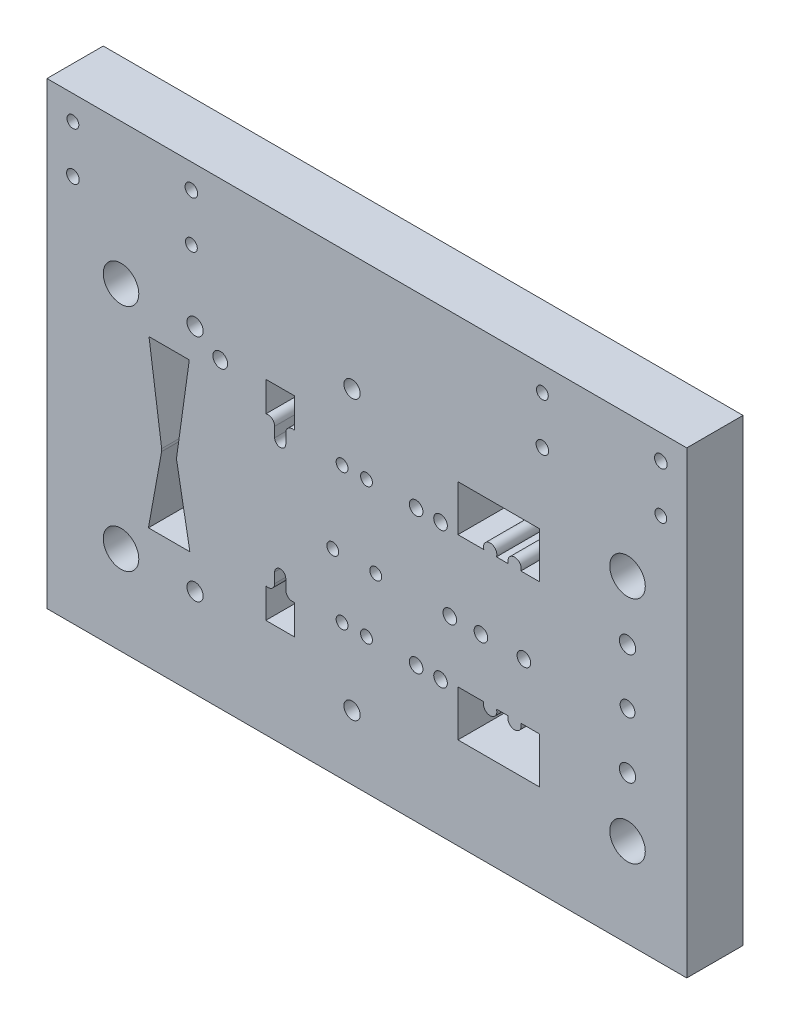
ISO-10303-21;
HEADER;
FILE_DESCRIPTION(('STEP AP214'),'2;1');
FILE_NAME('part.step','',(''),(''),'','','');
FILE_SCHEMA(('AUTOMOTIVE_DESIGN { 1 0 10303 214 1 1 1 1 }'));
ENDSEC;
DATA;
#1=APPLICATION_CONTEXT('core data for automotive mechanical design processes');
#2=APPLICATION_PROTOCOL_DEFINITION('international standard','automotive_design',2000,#1);
#3=PRODUCT_CONTEXT('',#1,'mechanical');
#4=PRODUCT('Part','Part','',(#3));
#5=PRODUCT_RELATED_PRODUCT_CATEGORY('part','',(#4));
#6=PRODUCT_DEFINITION_FORMATION('','',#4);
#7=PRODUCT_DEFINITION_CONTEXT('part definition',#1,'design');
#8=PRODUCT_DEFINITION('design','',#6,#7);
#9=PRODUCT_DEFINITION_SHAPE('','',#8);
#10=(LENGTH_UNIT() NAMED_UNIT(*) SI_UNIT(.MILLI.,.METRE.));
#11=(NAMED_UNIT(*) PLANE_ANGLE_UNIT() SI_UNIT($,.RADIAN.));
#12=(NAMED_UNIT(*) SI_UNIT($,.STERADIAN.) SOLID_ANGLE_UNIT());
#13=UNCERTAINTY_MEASURE_WITH_UNIT(LENGTH_MEASURE(1.E-05),#10,'distance_accuracy_value','');
#14=(GEOMETRIC_REPRESENTATION_CONTEXT(3) GLOBAL_UNCERTAINTY_ASSIGNED_CONTEXT((#13)) GLOBAL_UNIT_ASSIGNED_CONTEXT((#10,
#11,#12)) REPRESENTATION_CONTEXT('',''));
#15=CARTESIAN_POINT('',(0.,0.,0.));
#16=DIRECTION('',(0.,0.,1.));
#17=DIRECTION('',(1.,0.,0.));
#18=AXIS2_PLACEMENT_3D('',#15,#16,#17);
#19=CARTESIAN_POINT('',(392.,-210.,38.));
#20=DIRECTION('',(0.,0.,-1.));
#21=DIRECTION('',(-1.,0.,0.));
#22=AXIS2_PLACEMENT_3D('',#19,#20,#21);
#23=CYLINDRICAL_SURFACE('',#22,5.50000000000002);
#24=CARTESIAN_POINT('',(392.,-210.,38.));
#25=DIRECTION('',(0.,0.,-1.));
#26=DIRECTION('',(-1.,0.,0.));
#27=AXIS2_PLACEMENT_3D('',#24,#25,#26);
#28=CIRCLE('',#27,5.50000000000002);
#29=CARTESIAN_POINT('',(386.5,-210.,38.));
#30=VERTEX_POINT('',#29);
#31=EDGE_CURVE('E822',#30,#30,#28,.T.);
#32=ORIENTED_EDGE('',*,*,#31,.F.);
#33=EDGE_LOOP('',(#32));
#34=FACE_BOUND('',#33,.T.);
#35=CARTESIAN_POINT('',(392.,-210.,11.));
#36=DIRECTION('',(0.,0.,-1.));
#37=DIRECTION('',(-1.,0.,0.));
#38=AXIS2_PLACEMENT_3D('',#35,#36,#37);
#39=CIRCLE('',#38,5.50000000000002);
#40=CARTESIAN_POINT('',(386.5,-210.,11.));
#41=VERTEX_POINT('',#40);
#42=EDGE_CURVE('E35',#41,#41,#39,.F.);
#43=ORIENTED_EDGE('',*,*,#42,.F.);
#44=EDGE_LOOP('',(#43));
#45=FACE_BOUND('',#44,.T.);
#46=ADVANCED_FACE('F31',(#34,#45),#23,.F.);
#47=CARTESIAN_POINT('',(392.,-135.,38.));
#48=DIRECTION('',(0.,0.,-1.));
#49=DIRECTION('',(-1.,0.,0.));
#50=AXIS2_PLACEMENT_3D('',#47,#48,#49);
#51=CYLINDRICAL_SURFACE('',#50,5.50000000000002);
#52=CARTESIAN_POINT('',(392.,-135.,38.));
#53=DIRECTION('',(0.,0.,-1.));
#54=DIRECTION('',(-1.,0.,0.));
#55=AXIS2_PLACEMENT_3D('',#52,#53,#54);
#56=CIRCLE('',#55,5.50000000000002);
#57=CARTESIAN_POINT('',(386.5,-135.,38.));
#58=VERTEX_POINT('',#57);
#59=EDGE_CURVE('E825',#58,#58,#56,.T.);
#60=ORIENTED_EDGE('',*,*,#59,.F.);
#61=EDGE_LOOP('',(#60));
#62=FACE_BOUND('',#61,.T.);
#63=CARTESIAN_POINT('',(392.,-135.,11.));
#64=DIRECTION('',(0.,0.,-1.));
#65=DIRECTION('',(-1.,0.,0.));
#66=AXIS2_PLACEMENT_3D('',#63,#64,#65);
#67=CIRCLE('',#66,5.50000000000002);
#68=CARTESIAN_POINT('',(386.5,-135.,11.));
#69=VERTEX_POINT('',#68);
#70=EDGE_CURVE('E780',#69,#69,#67,.F.);
#71=ORIENTED_EDGE('',*,*,#70,.F.);
#72=EDGE_LOOP('',(#71));
#73=FACE_BOUND('',#72,.T.);
#74=ADVANCED_FACE('F910',(#62,#73),#51,.F.);
#75=CARTESIAN_POINT('',(206.,-266.5,38.));
#76=DIRECTION('',(0.,0.,-1.));
#77=DIRECTION('',(-1.,0.,0.));
#78=AXIS2_PLACEMENT_3D('',#75,#76,#77);
#79=CYLINDRICAL_SURFACE('',#78,5.50000000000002);
#80=CARTESIAN_POINT('',(206.,-266.5,38.));
#81=DIRECTION('',(0.,0.,-1.));
#82=DIRECTION('',(-1.,0.,0.));
#83=AXIS2_PLACEMENT_3D('',#80,#81,#82);
#84=CIRCLE('',#83,5.50000000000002);
#85=CARTESIAN_POINT('',(200.5,-266.5,38.));
#86=VERTEX_POINT('',#85);
#87=EDGE_CURVE('E764',#86,#86,#84,.T.);
#88=ORIENTED_EDGE('',*,*,#87,.F.);
#89=EDGE_LOOP('',(#88));
#90=FACE_BOUND('',#89,.T.);
#91=CARTESIAN_POINT('',(206.,-266.5,11.));
#92=DIRECTION('',(0.,0.,-1.));
#93=DIRECTION('',(-1.,0.,0.));
#94=AXIS2_PLACEMENT_3D('',#91,#92,#93);
#95=CIRCLE('',#94,5.50000000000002);
#96=CARTESIAN_POINT('',(200.5,-266.5,11.));
#97=VERTEX_POINT('',#96);
#98=EDGE_CURVE('E776',#97,#97,#95,.F.);
#99=ORIENTED_EDGE('',*,*,#98,.F.);
#100=EDGE_LOOP('',(#99));
#101=FACE_BOUND('',#100,.T.);
#102=ADVANCED_FACE('F916',(#90,#101),#79,.F.);
#103=CARTESIAN_POINT('',(206.,-78.5000000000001,38.));
#104=DIRECTION('',(0.,0.,-1.));
#105=DIRECTION('',(-1.,0.,0.));
#106=AXIS2_PLACEMENT_3D('',#103,#104,#105);
#107=CYLINDRICAL_SURFACE('',#106,5.50000000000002);
#108=CARTESIAN_POINT('',(206.,-78.5000000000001,38.));
#109=DIRECTION('',(0.,0.,-1.));
#110=DIRECTION('',(-1.,0.,0.));
#111=AXIS2_PLACEMENT_3D('',#108,#109,#110);
#112=CIRCLE('',#111,5.50000000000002);
#113=CARTESIAN_POINT('',(200.5,-78.5000000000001,38.));
#114=VERTEX_POINT('',#113);
#115=EDGE_CURVE('E819',#114,#114,#112,.T.);
#116=ORIENTED_EDGE('',*,*,#115,.F.);
#117=EDGE_LOOP('',(#116));
#118=FACE_BOUND('',#117,.T.);
#119=CARTESIAN_POINT('',(206.,-78.5000000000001,11.));
#120=DIRECTION('',(0.,0.,-1.));
#121=DIRECTION('',(-1.,0.,0.));
#122=AXIS2_PLACEMENT_3D('',#119,#120,#121);
#123=CIRCLE('',#122,5.50000000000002);
#124=CARTESIAN_POINT('',(200.5,-78.5000000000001,11.));
#125=VERTEX_POINT('',#124);
#126=EDGE_CURVE('E771',#125,#125,#123,.F.);
#127=ORIENTED_EDGE('',*,*,#126,.F.);
#128=EDGE_LOOP('',(#127));
#129=FACE_BOUND('',#128,.T.);
#130=ADVANCED_FACE('F922',(#118,#129),#107,.F.);
#131=CARTESIAN_POINT('',(100.,-250.,38.));
#132=DIRECTION('',(0.,0.,-1.));
#133=DIRECTION('',(-1.,0.,0.));
#134=AXIS2_PLACEMENT_3D('',#131,#132,#133);
#135=CYLINDRICAL_SURFACE('',#134,5.5);
#136=CARTESIAN_POINT('',(100.,-250.,38.));
#137=DIRECTION('',(0.,0.,-1.));
#138=DIRECTION('',(-1.,0.,0.));
#139=AXIS2_PLACEMENT_3D('',#136,#137,#138);
#140=CIRCLE('',#139,5.5);
#141=CARTESIAN_POINT('',(94.5,-250.,38.));
#142=VERTEX_POINT('',#141);
#143=EDGE_CURVE('E813',#142,#142,#140,.T.);
#144=ORIENTED_EDGE('',*,*,#143,.F.);
#145=EDGE_LOOP('',(#144));
#146=FACE_BOUND('',#145,.T.);
#147=CARTESIAN_POINT('',(100.,-250.,11.));
#148=DIRECTION('',(0.,0.,-1.));
#149=DIRECTION('',(-1.,0.,0.));
#150=AXIS2_PLACEMENT_3D('',#147,#148,#149);
#151=CIRCLE('',#150,5.5);
#152=CARTESIAN_POINT('',(94.5,-250.,11.));
#153=VERTEX_POINT('',#152);
#154=EDGE_CURVE('E766',#153,#153,#151,.F.);
#155=ORIENTED_EDGE('',*,*,#154,.F.);
#156=EDGE_LOOP('',(#155));
#157=FACE_BOUND('',#156,.T.);
#158=ADVANCED_FACE('F1208',(#146,#157),#135,.F.);
#159=CARTESIAN_POINT('',(100.,-95.0000000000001,38.));
#160=DIRECTION('',(0.,0.,-1.));
#161=DIRECTION('',(-1.,0.,0.));
#162=AXIS2_PLACEMENT_3D('',#159,#160,#161);
#163=CYLINDRICAL_SURFACE('',#162,5.5);
#164=CARTESIAN_POINT('',(100.,-95.0000000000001,38.));
#165=DIRECTION('',(0.,0.,-1.));
#166=DIRECTION('',(-1.,0.,0.));
#167=AXIS2_PLACEMENT_3D('',#164,#165,#166);
#168=CIRCLE('',#167,5.5);
#169=CARTESIAN_POINT('',(94.5,-95.0000000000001,38.));
#170=VERTEX_POINT('',#169);
#171=EDGE_CURVE('E816',#170,#170,#168,.T.);
#172=ORIENTED_EDGE('',*,*,#171,.F.);
#173=EDGE_LOOP('',(#172));
#174=FACE_BOUND('',#173,.T.);
#175=CARTESIAN_POINT('',(100.,-95.0000000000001,11.));
#176=DIRECTION('',(0.,0.,-1.));
#177=DIRECTION('',(-1.,0.,0.));
#178=AXIS2_PLACEMENT_3D('',#175,#176,#177);
#179=CIRCLE('',#178,5.5);
#180=CARTESIAN_POINT('',(94.5,-95.0000000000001,11.));
#181=VERTEX_POINT('',#180);
#182=EDGE_CURVE('E761',#181,#181,#179,.F.);
#183=ORIENTED_EDGE('',*,*,#182,.F.);
#184=EDGE_LOOP('',(#183));
#185=FACE_BOUND('',#184,.T.);
#186=ADVANCED_FACE('F1204',(#174,#185),#163,.F.);
#187=CARTESIAN_POINT('',(0.,0.,38.));
#188=DIRECTION('',(1.,0.,0.));
#189=DIRECTION('',(0.,1.,0.));
#190=AXIS2_PLACEMENT_3D('',#187,#188,#189);
#191=PLANE('',#190);
#192=DIRECTION('',(0.,-1.,0.));
#193=VECTOR('',#192,1.);
#194=CARTESIAN_POINT('',(0.,0.,0.));
#195=LINE('',#194,#193);
#196=CARTESIAN_POINT('',(0.,0.,0.));
#197=VERTEX_POINT('',#196);
#198=CARTESIAN_POINT('',(0.,-310.,0.));
#199=VERTEX_POINT('',#198);
#200=EDGE_CURVE('E735',#197,#199,#195,.T.);
#201=ORIENTED_EDGE('',*,*,#200,.T.);
#202=DIRECTION('',(0.,0.,-1.));
#203=VECTOR('',#202,1.);
#204=CARTESIAN_POINT('',(0.,-310.,38.));
#205=LINE('',#204,#203);
#206=CARTESIAN_POINT('',(0.,-310.,38.));
#207=VERTEX_POINT('',#206);
#208=EDGE_CURVE('E11',#207,#199,#205,.T.);
#209=ORIENTED_EDGE('',*,*,#208,.F.);
#210=DIRECTION('',(0.,-1.,0.));
#211=VECTOR('',#210,1.);
#212=CARTESIAN_POINT('',(0.,0.,38.));
#213=LINE('',#212,#211);
#214=CARTESIAN_POINT('',(0.,0.,38.));
#215=VERTEX_POINT('',#214);
#216=EDGE_CURVE('E744',#215,#207,#213,.T.);
#217=ORIENTED_EDGE('',*,*,#216,.F.);
#218=DIRECTION('',(0.,0.,-1.));
#219=VECTOR('',#218,1.);
#220=CARTESIAN_POINT('',(0.,0.,38.));
#221=LINE('',#220,#219);
#222=EDGE_CURVE('E753',#215,#197,#221,.T.);
#223=ORIENTED_EDGE('',*,*,#222,.T.);
#224=EDGE_LOOP('',(#201,#209,#217,#223));
#225=FACE_BOUND('',#224,.T.);
#226=ADVANCED_FACE('F33',(#225),#191,.F.);
#227=CARTESIAN_POINT('',(0.,-310.,38.));
#228=DIRECTION('',(0.,1.,0.));
#229=DIRECTION('',(0.,0.,1.));
#230=AXIS2_PLACEMENT_3D('',#227,#228,#229);
#231=PLANE('',#230);
#232=DIRECTION('',(1.,0.,0.));
#233=VECTOR('',#232,1.);
#234=CARTESIAN_POINT('',(0.,-310.,0.));
#235=LINE('',#234,#233);
#236=CARTESIAN_POINT('',(432.,-310.,0.));
#237=VERTEX_POINT('',#236);
#238=EDGE_CURVE('E738',#199,#237,#235,.T.);
#239=ORIENTED_EDGE('',*,*,#238,.T.);
#240=DIRECTION('',(0.,0.,-1.));
#241=VECTOR('',#240,1.);
#242=CARTESIAN_POINT('',(432.,-310.,38.));
#243=LINE('',#242,#241);
#244=CARTESIAN_POINT('',(432.,-310.,38.));
#245=VERTEX_POINT('',#244);
#246=EDGE_CURVE('E40',#245,#237,#243,.T.);
#247=ORIENTED_EDGE('',*,*,#246,.F.);
#248=DIRECTION('',(1.,0.,0.));
#249=VECTOR('',#248,1.);
#250=CARTESIAN_POINT('',(0.,-310.,38.));
#251=LINE('',#250,#249);
#252=EDGE_CURVE('E747',#207,#245,#251,.T.);
#253=ORIENTED_EDGE('',*,*,#252,.F.);
#254=ORIENTED_EDGE('',*,*,#208,.T.);
#255=EDGE_LOOP('',(#239,#247,#253,#254));
#256=FACE_BOUND('',#255,.T.);
#257=ADVANCED_FACE('F1189',(#256),#231,.F.);
#258=CARTESIAN_POINT('',(432.,0.,38.));
#259=DIRECTION('',(-1.,0.,0.));
#260=DIRECTION('',(0.,-1.,0.));
#261=AXIS2_PLACEMENT_3D('',#258,#259,#260);
#262=PLANE('',#261);
#263=DIRECTION('',(0.,1.,0.));
#264=VECTOR('',#263,1.);
#265=CARTESIAN_POINT('',(432.,0.,0.));
#266=LINE('',#265,#264);
#267=CARTESIAN_POINT('',(432.,0.,0.));
#268=VERTEX_POINT('',#267);
#269=EDGE_CURVE('E740',#237,#268,#266,.T.);
#270=ORIENTED_EDGE('',*,*,#269,.T.);
#271=DIRECTION('',(0.,0.,-1.));
#272=VECTOR('',#271,1.);
#273=CARTESIAN_POINT('',(432.,0.,38.));
#274=LINE('',#273,#272);
#275=CARTESIAN_POINT('',(432.,0.,38.));
#276=VERTEX_POINT('',#275);
#277=EDGE_CURVE('E756',#276,#268,#274,.T.);
#278=ORIENTED_EDGE('',*,*,#277,.F.);
#279=DIRECTION('',(0.,1.,0.));
#280=VECTOR('',#279,1.);
#281=CARTESIAN_POINT('',(432.,0.,38.));
#282=LINE('',#281,#280);
#283=EDGE_CURVE('E749',#245,#276,#282,.T.);
#284=ORIENTED_EDGE('',*,*,#283,.F.);
#285=ORIENTED_EDGE('',*,*,#246,.T.);
#286=EDGE_LOOP('',(#270,#278,#284,#285));
#287=FACE_BOUND('',#286,.T.);
#288=ADVANCED_FACE('F904',(#287),#262,.F.);
#289=CARTESIAN_POINT('',(0.,0.,38.));
#290=DIRECTION('',(0.,-1.,0.));
#291=DIRECTION('',(1.,0.,0.));
#292=AXIS2_PLACEMENT_3D('',#289,#290,#291);
#293=PLANE('',#292);
#294=DIRECTION('',(-1.,0.,0.));
#295=VECTOR('',#294,1.);
#296=CARTESIAN_POINT('',(0.,0.,0.));
#297=LINE('',#296,#295);
#298=EDGE_CURVE('E742',#268,#197,#297,.T.);
#299=ORIENTED_EDGE('',*,*,#298,.T.);
#300=ORIENTED_EDGE('',*,*,#222,.F.);
#301=DIRECTION('',(-1.,0.,0.));
#302=VECTOR('',#301,1.);
#303=CARTESIAN_POINT('',(0.,0.,38.));
#304=LINE('',#303,#302);
#305=EDGE_CURVE('E751',#276,#215,#304,.T.);
#306=ORIENTED_EDGE('',*,*,#305,.F.);
#307=ORIENTED_EDGE('',*,*,#277,.T.);
#308=EDGE_LOOP('',(#299,#300,#306,#307));
#309=FACE_BOUND('',#308,.T.);
#310=ADVANCED_FACE('F894',(#309),#293,.F.);
#311=CARTESIAN_POINT('',(0.,-310.,38.));
#312=DIRECTION('',(0.,0.,1.));
#313=DIRECTION('',(1.,0.,0.));
#314=AXIS2_PLACEMENT_3D('',#311,#312,#313);
#315=PLANE('',#314);
#316=CARTESIAN_POINT('',(117.,-106.,38.));
#317=DIRECTION('',(0.,0.,-1.));
#318=DIRECTION('',(-1.,0.,0.));
#319=AXIS2_PLACEMENT_3D('',#316,#317,#318);
#320=CIRCLE('',#319,4.99999999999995);
#321=CARTESIAN_POINT('',(112.,-106.,38.));
#322=VERTEX_POINT('',#321);
#323=EDGE_CURVE('E1278',#322,#322,#320,.T.);
#324=ORIENTED_EDGE('',*,*,#323,.T.);
#325=EDGE_LOOP('',(#324));
#326=FACE_BOUND('',#325,.T.);
#327=CARTESIAN_POINT('',(392.,-172.5,38.));
#328=DIRECTION('',(0.,0.,-1.));
#329=DIRECTION('',(-1.,0.,0.));
#330=AXIS2_PLACEMENT_3D('',#327,#328,#329);
#331=CIRCLE('',#330,4.99999999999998);
#332=CARTESIAN_POINT('',(387.,-172.5,38.));
#333=VERTEX_POINT('',#332);
#334=EDGE_CURVE('E1288',#333,#333,#331,.T.);
#335=ORIENTED_EDGE('',*,*,#334,.T.);
#336=EDGE_LOOP('',(#335));
#337=FACE_BOUND('',#336,.T.);
#338=ORIENTED_EDGE('',*,*,#87,.T.);
#339=EDGE_LOOP('',(#338));
#340=FACE_BOUND('',#339,.T.);
#341=ORIENTED_EDGE('',*,*,#143,.T.);
#342=EDGE_LOOP('',(#341));
#343=FACE_BOUND('',#342,.T.);
#344=ORIENTED_EDGE('',*,*,#171,.T.);
#345=EDGE_LOOP('',(#344));
#346=FACE_BOUND('',#345,.T.);
#347=ORIENTED_EDGE('',*,*,#115,.T.);
#348=EDGE_LOOP('',(#347));
#349=FACE_BOUND('',#348,.T.);
#350=ORIENTED_EDGE('',*,*,#31,.T.);
#351=EDGE_LOOP('',(#350));
#352=FACE_BOUND('',#351,.T.);
#353=ORIENTED_EDGE('',*,*,#59,.T.);
#354=EDGE_LOOP('',(#353));
#355=FACE_BOUND('',#354,.T.);
#356=CARTESIAN_POINT('',(97.5,-16.5,38.));
#357=DIRECTION('',(0.,0.,-1.));
#358=DIRECTION('',(-1.,0.,0.));
#359=AXIS2_PLACEMENT_3D('',#356,#357,#358);
#360=CIRCLE('',#359,4.25000000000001);
#361=CARTESIAN_POINT('',(93.25,-16.5,38.));
#362=VERTEX_POINT('',#361);
#363=EDGE_CURVE('E831',#362,#362,#360,.T.);
#364=ORIENTED_EDGE('',*,*,#363,.T.);
#365=EDGE_LOOP('',(#364));
#366=FACE_BOUND('',#365,.T.);
#367=CARTESIAN_POINT('',(17.5,-48.5,38.));
#368=DIRECTION('',(0.,0.,-1.));
#369=DIRECTION('',(-1.,0.,0.));
#370=AXIS2_PLACEMENT_3D('',#367,#368,#369);
#371=CIRCLE('',#370,4.25);
#372=CARTESIAN_POINT('',(13.25,-48.5,38.));
#373=VERTEX_POINT('',#372);
#374=EDGE_CURVE('E837',#373,#373,#371,.T.);
#375=ORIENTED_EDGE('',*,*,#374,.T.);
#376=EDGE_LOOP('',(#375));
#377=FACE_BOUND('',#376,.T.);
#378=CARTESIAN_POINT('',(97.5000000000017,-48.4999999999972,38.));
#379=DIRECTION('',(0.,0.,-1.));
#380=DIRECTION('',(-1.,0.,0.));
#381=AXIS2_PLACEMENT_3D('',#378,#379,#380);
#382=CIRCLE('',#381,4.00000000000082);
#383=CARTESIAN_POINT('',(93.5000000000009,-48.4999999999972,38.));
#384=VERTEX_POINT('',#383);
#385=EDGE_CURVE('E843',#384,#384,#382,.T.);
#386=ORIENTED_EDGE('',*,*,#385,.T.);
#387=EDGE_LOOP('',(#386));
#388=FACE_BOUND('',#387,.T.);
#389=CARTESIAN_POINT('',(17.5000000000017,-16.4999999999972,38.));
#390=DIRECTION('',(0.,0.,-1.));
#391=DIRECTION('',(-1.,0.,0.));
#392=AXIS2_PLACEMENT_3D('',#389,#390,#391);
#393=CIRCLE('',#392,4.00000000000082);
#394=CARTESIAN_POINT('',(13.5000000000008,-16.4999999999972,38.));
#395=VERTEX_POINT('',#394);
#396=EDGE_CURVE('E849',#395,#395,#393,.T.);
#397=ORIENTED_EDGE('',*,*,#396,.T.);
#398=EDGE_LOOP('',(#397));
#399=FACE_BOUND('',#398,.T.);
#400=CARTESIAN_POINT('',(414.5,-16.5,38.));
#401=DIRECTION('',(0.,0.,-1.));
#402=DIRECTION('',(-1.,0.,0.));
#403=AXIS2_PLACEMENT_3D('',#400,#401,#402);
#404=CIRCLE('',#403,4.24999999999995);
#405=CARTESIAN_POINT('',(410.25,-16.5,38.));
#406=VERTEX_POINT('',#405);
#407=EDGE_CURVE('E855',#406,#406,#404,.T.);
#408=ORIENTED_EDGE('',*,*,#407,.T.);
#409=EDGE_LOOP('',(#408));
#410=FACE_BOUND('',#409,.T.);
#411=CARTESIAN_POINT('',(334.5,-48.5,38.));
#412=DIRECTION('',(0.,0.,-1.));
#413=DIRECTION('',(-1.,0.,0.));
#414=AXIS2_PLACEMENT_3D('',#411,#412,#413);
#415=CIRCLE('',#414,4.24999999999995);
#416=CARTESIAN_POINT('',(330.25,-48.5,38.));
#417=VERTEX_POINT('',#416);
#418=EDGE_CURVE('E861',#417,#417,#415,.T.);
#419=ORIENTED_EDGE('',*,*,#418,.T.);
#420=EDGE_LOOP('',(#419));
#421=FACE_BOUND('',#420,.T.);
#422=CARTESIAN_POINT('',(414.499999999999,-48.4999999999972,38.));
#423=DIRECTION('',(0.,0.,-1.));
#424=DIRECTION('',(-1.,0.,0.));
#425=AXIS2_PLACEMENT_3D('',#422,#423,#424);
#426=CIRCLE('',#425,3.99999999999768);
#427=CARTESIAN_POINT('',(410.500000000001,-48.4999999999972,38.));
#428=VERTEX_POINT('',#427);
#429=EDGE_CURVE('E867',#428,#428,#426,.T.);
#430=ORIENTED_EDGE('',*,*,#429,.T.);
#431=EDGE_LOOP('',(#430));
#432=FACE_BOUND('',#431,.T.);
#433=CARTESIAN_POINT('',(334.500000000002,-16.4999999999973,38.));
#434=DIRECTION('',(0.,0.,-1.));
#435=DIRECTION('',(-1.,0.,0.));
#436=AXIS2_PLACEMENT_3D('',#433,#434,#435);
#437=CIRCLE('',#436,4.00000000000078);
#438=CARTESIAN_POINT('',(330.500000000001,-16.4999999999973,38.));
#439=VERTEX_POINT('',#438);
#440=EDGE_CURVE('E873',#439,#439,#437,.T.);
#441=ORIENTED_EDGE('',*,*,#440,.T.);
#442=EDGE_LOOP('',(#441));
#443=FACE_BOUND('',#442,.T.);
#444=CARTESIAN_POINT('',(272.,-178.5,38.));
#445=DIRECTION('',(0.,0.,1.));
#446=DIRECTION('',(1.,0.,0.));
#447=AXIS2_PLACEMENT_3D('',#444,#445,#446);
#448=CIRCLE('',#447,4.60000000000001);
#449=CARTESIAN_POINT('',(276.6,-178.5,38.));
#450=VERTEX_POINT('',#449);
#451=EDGE_CURVE('E876',#450,#450,#448,.T.);
#452=ORIENTED_EDGE('',*,*,#451,.F.);
#453=EDGE_LOOP('',(#452));
#454=FACE_BOUND('',#453,.T.);
#455=CARTESIAN_POINT('',(71.9999999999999,-178.5,38.));
#456=DIRECTION('',(0.,0.,-1.));
#457=DIRECTION('',(1.,0.,0.));
#458=AXIS2_PLACEMENT_3D('',#455,#456,#457);
#459=CIRCLE('',#458,5.5);
#460=CARTESIAN_POINT('',(77.4471712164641,-177.739522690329,38.));
#461=VERTEX_POINT('',#460);
#462=CARTESIAN_POINT('',(77.4114359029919,-179.483036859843,38.));
#463=VERTEX_POINT('',#462);
#464=EDGE_CURVE('E48',#461,#463,#459,.T.);
#465=ORIENTED_EDGE('',*,*,#464,.F.);
#466=DIRECTION('',(0.138268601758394,-0.990394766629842,0.));
#467=VECTOR('',#466,1.);
#468=CARTESIAN_POINT('',(68.8975469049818,-116.5,38.));
#469=LINE('',#468,#467);
#470=CARTESIAN_POINT('',(68.8975469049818,-116.5,38.));
#471=VERTEX_POINT('',#470);
#472=EDGE_CURVE('E347',#471,#461,#469,.T.);
#473=ORIENTED_EDGE('',*,*,#472,.F.);
#474=DIRECTION('',(-1.,0.,0.));
#475=VECTOR('',#474,1.);
#476=CARTESIAN_POINT('',(96.102453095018,-116.5,38.));
#477=LINE('',#476,#475);
#478=CARTESIAN_POINT('',(96.102453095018,-116.5,38.));
#479=VERTEX_POINT('',#478);
#480=EDGE_CURVE('E344',#479,#471,#477,.T.);
#481=ORIENTED_EDGE('',*,*,#480,.F.);
#482=DIRECTION('',(0.138268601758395,0.990394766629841,0.));
#483=VECTOR('',#482,1.);
#484=CARTESIAN_POINT('',(87.5528287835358,-177.739522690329,38.));
#485=LINE('',#484,#483);
#486=CARTESIAN_POINT('',(87.5528287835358,-177.739522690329,38.));
#487=VERTEX_POINT('',#486);
#488=EDGE_CURVE('E341',#487,#479,#485,.T.);
#489=ORIENTED_EDGE('',*,*,#488,.F.);
#490=CARTESIAN_POINT('',(92.9999999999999,-178.5,38.));
#491=DIRECTION('',(0.,0.,-1.));
#492=DIRECTION('',(1.,0.,0.));
#493=AXIS2_PLACEMENT_3D('',#490,#491,#492);
#494=CIRCLE('',#493,5.5);
#495=CARTESIAN_POINT('',(87.5885640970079,-179.483036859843,38.));
#496=VERTEX_POINT('',#495);
#497=EDGE_CURVE('E335',#496,#487,#494,.T.);
#498=ORIENTED_EDGE('',*,*,#497,.F.);
#499=DIRECTION('',(-0.178733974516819,0.983897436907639,0.));
#500=VECTOR('',#499,1.);
#501=CARTESIAN_POINT('',(96.4929440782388,-228.5,38.));
#502=LINE('',#501,#500);
#503=CARTESIAN_POINT('',(96.4929440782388,-228.5,38.));
#504=VERTEX_POINT('',#503);
#505=EDGE_CURVE('E333',#504,#496,#502,.T.);
#506=ORIENTED_EDGE('',*,*,#505,.F.);
#507=DIRECTION('',(1.,0.,0.));
#508=VECTOR('',#507,1.);
#509=CARTESIAN_POINT('',(68.5070559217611,-228.5,38.));
#510=LINE('',#509,#508);
#511=CARTESIAN_POINT('',(68.5070559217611,-228.5,38.));
#512=VERTEX_POINT('',#511);
#513=EDGE_CURVE('E316',#512,#504,#510,.T.);
#514=ORIENTED_EDGE('',*,*,#513,.F.);
#515=DIRECTION('',(-0.178733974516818,-0.983897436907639,0.));
#516=VECTOR('',#515,1.);
#517=CARTESIAN_POINT('',(77.4114359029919,-179.483036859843,38.));
#518=LINE('',#517,#516);
#519=EDGE_CURVE('E325',#463,#512,#518,.T.);
#520=ORIENTED_EDGE('',*,*,#519,.F.);
#521=EDGE_LOOP('',(#465,#473,#481,#489,#498,#506,#514,#520));
#522=FACE_BOUND('',#521,.T.);
#523=DIRECTION('',(0.,-1.,0.));
#524=VECTOR('',#523,1.);
#525=CARTESIAN_POINT('',(147.75,-222.742640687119,38.));
#526=LINE('',#525,#524);
#527=CARTESIAN_POINT('',(147.75,-222.742640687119,38.));
#528=VERTEX_POINT('',#527);
#529=CARTESIAN_POINT('',(147.75,-243.,38.));
#530=VERTEX_POINT('',#529);
#531=EDGE_CURVE('E373',#528,#530,#526,.T.);
#532=ORIENTED_EDGE('',*,*,#531,.F.);
#533=CARTESIAN_POINT('',(149.25,-218.5,38.));
#534=DIRECTION('',(0.,0.,-1.));
#535=DIRECTION('',(1.,0.,0.));
#536=AXIS2_PLACEMENT_3D('',#533,#534,#535);
#537=CIRCLE('',#536,4.50000000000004);
#538=CARTESIAN_POINT('',(153.75,-218.5,38.));
#539=VERTEX_POINT('',#538);
#540=EDGE_CURVE('E403',#539,#528,#537,.T.);
#541=ORIENTED_EDGE('',*,*,#540,.F.);
#542=DIRECTION('',(0.,-1.,0.));
#543=VECTOR('',#542,1.);
#544=CARTESIAN_POINT('',(153.75,-211.75,38.));
#545=LINE('',#544,#543);
#546=CARTESIAN_POINT('',(153.75,-211.75,38.));
#547=VERTEX_POINT('',#546);
#548=EDGE_CURVE('E400',#547,#539,#545,.T.);
#549=ORIENTED_EDGE('',*,*,#548,.F.);
#550=CARTESIAN_POINT('',(157.5,-211.75,38.));
#551=DIRECTION('',(0.,0.,1.));
#552=DIRECTION('',(1.,0.,0.));
#553=AXIS2_PLACEMENT_3D('',#550,#551,#552);
#554=CIRCLE('',#553,3.75);
#555=CARTESIAN_POINT('',(161.25,-211.75,38.));
#556=VERTEX_POINT('',#555);
#557=EDGE_CURVE('E397',#556,#547,#554,.T.);
#558=ORIENTED_EDGE('',*,*,#557,.F.);
#559=DIRECTION('',(0.,1.,0.));
#560=VECTOR('',#559,1.);
#561=CARTESIAN_POINT('',(161.25,-218.5,38.));
#562=LINE('',#561,#560);
#563=CARTESIAN_POINT('',(161.25,-218.5,38.));
#564=VERTEX_POINT('',#563);
#565=EDGE_CURVE('E394',#564,#556,#562,.T.);
#566=ORIENTED_EDGE('',*,*,#565,.F.);
#567=CARTESIAN_POINT('',(165.75,-218.5,38.));
#568=DIRECTION('',(0.,0.,-1.));
#569=DIRECTION('',(1.,0.,0.));
#570=AXIS2_PLACEMENT_3D('',#567,#568,#569);
#571=CIRCLE('',#570,4.50000000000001);
#572=CARTESIAN_POINT('',(167.25,-222.742640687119,38.));
#573=VERTEX_POINT('',#572);
#574=EDGE_CURVE('E391',#573,#564,#571,.T.);
#575=ORIENTED_EDGE('',*,*,#574,.F.);
#576=DIRECTION('',(0.,1.,0.));
#577=VECTOR('',#576,1.);
#578=CARTESIAN_POINT('',(167.25,-243.,38.));
#579=LINE('',#578,#577);
#580=CARTESIAN_POINT('',(167.25,-243.,38.));
#581=VERTEX_POINT('',#580);
#582=EDGE_CURVE('E388',#581,#573,#579,.T.);
#583=ORIENTED_EDGE('',*,*,#582,.F.);
#584=DIRECTION('',(1.,0.,0.));
#585=VECTOR('',#584,1.);
#586=CARTESIAN_POINT('',(147.75,-243.,38.));
#587=LINE('',#586,#585);
#588=EDGE_CURVE('E385',#530,#581,#587,.T.);
#589=ORIENTED_EDGE('',*,*,#588,.F.);
#590=EDGE_LOOP('',(#532,#541,#549,#558,#566,#575,#583,#589));
#591=FACE_BOUND('',#590,.T.);
#592=CARTESIAN_POINT('',(165.75,-126.5,38.));
#593=DIRECTION('',(0.,0.,-1.));
#594=DIRECTION('',(1.,0.,0.));
#595=AXIS2_PLACEMENT_3D('',#592,#593,#594);
#596=CIRCLE('',#595,4.5);
#597=CARTESIAN_POINT('',(161.25,-126.5,38.));
#598=VERTEX_POINT('',#597);
#599=CARTESIAN_POINT('',(167.25,-122.257359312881,38.));
#600=VERTEX_POINT('',#599);
#601=EDGE_CURVE('E433',#598,#600,#596,.T.);
#602=ORIENTED_EDGE('',*,*,#601,.F.);
#603=DIRECTION('',(0.,1.,0.));
#604=VECTOR('',#603,1.);
#605=CARTESIAN_POINT('',(161.25,-133.25,38.));
#606=LINE('',#605,#604);
#607=CARTESIAN_POINT('',(161.25,-133.25,38.));
#608=VERTEX_POINT('',#607);
#609=EDGE_CURVE('E467',#608,#598,#606,.T.);
#610=ORIENTED_EDGE('',*,*,#609,.F.);
#611=CARTESIAN_POINT('',(157.5,-133.25,38.));
#612=DIRECTION('',(0.,0.,1.));
#613=DIRECTION('',(1.,0.,0.));
#614=AXIS2_PLACEMENT_3D('',#611,#612,#613);
#615=CIRCLE('',#614,3.75000000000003);
#616=CARTESIAN_POINT('',(153.75,-133.25,38.));
#617=VERTEX_POINT('',#616);
#618=EDGE_CURVE('E464',#617,#608,#615,.T.);
#619=ORIENTED_EDGE('',*,*,#618,.F.);
#620=DIRECTION('',(0.,-1.,0.));
#621=VECTOR('',#620,1.);
#622=CARTESIAN_POINT('',(153.75,-126.5,38.));
#623=LINE('',#622,#621);
#624=CARTESIAN_POINT('',(153.75,-126.5,38.));
#625=VERTEX_POINT('',#624);
#626=EDGE_CURVE('E461',#625,#617,#623,.T.);
#627=ORIENTED_EDGE('',*,*,#626,.F.);
#628=CARTESIAN_POINT('',(149.25,-126.5,38.));
#629=DIRECTION('',(0.,0.,-1.));
#630=DIRECTION('',(1.,0.,0.));
#631=AXIS2_PLACEMENT_3D('',#628,#629,#630);
#632=CIRCLE('',#631,4.49999999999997);
#633=CARTESIAN_POINT('',(147.75,-122.257359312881,38.));
#634=VERTEX_POINT('',#633);
#635=EDGE_CURVE('E458',#634,#625,#632,.T.);
#636=ORIENTED_EDGE('',*,*,#635,.F.);
#637=DIRECTION('',(0.,-1.,0.));
#638=VECTOR('',#637,1.);
#639=CARTESIAN_POINT('',(147.75,-102.,38.));
#640=LINE('',#639,#638);
#641=CARTESIAN_POINT('',(147.75,-102.,38.));
#642=VERTEX_POINT('',#641);
#643=EDGE_CURVE('E455',#642,#634,#640,.T.);
#644=ORIENTED_EDGE('',*,*,#643,.F.);
#645=DIRECTION('',(-1.,0.,0.));
#646=VECTOR('',#645,1.);
#647=CARTESIAN_POINT('',(167.25,-102.,38.));
#648=LINE('',#647,#646);
#649=CARTESIAN_POINT('',(167.25,-102.,38.));
#650=VERTEX_POINT('',#649);
#651=EDGE_CURVE('E452',#650,#642,#648,.T.);
#652=ORIENTED_EDGE('',*,*,#651,.F.);
#653=DIRECTION('',(0.,1.,0.));
#654=VECTOR('',#653,1.);
#655=CARTESIAN_POINT('',(167.25,-122.257359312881,38.));
#656=LINE('',#655,#654);
#657=EDGE_CURVE('E449',#600,#650,#656,.T.);
#658=ORIENTED_EDGE('',*,*,#657,.F.);
#659=EDGE_LOOP('',(#602,#610,#619,#627,#636,#644,#652,#658));
#660=FACE_BOUND('',#659,.T.);
#661=CARTESIAN_POINT('',(199.25,-218.5,38.));
#662=DIRECTION('',(0.,0.,1.));
#663=DIRECTION('',(1.,0.,0.));
#664=AXIS2_PLACEMENT_3D('',#661,#662,#663);
#665=CIRCLE('',#664,4.);
#666=CARTESIAN_POINT('',(203.25,-218.5,38.));
#667=VERTEX_POINT('',#666);
#668=EDGE_CURVE('E497',#667,#667,#665,.T.);
#669=ORIENTED_EDGE('',*,*,#668,.F.);
#670=EDGE_LOOP('',(#669));
#671=FACE_BOUND('',#670,.T.);
#672=CARTESIAN_POINT('',(215.75,-218.5,38.));
#673=DIRECTION('',(0.,0.,1.));
#674=DIRECTION('',(1.,0.,0.));
#675=AXIS2_PLACEMENT_3D('',#672,#673,#674);
#676=CIRCLE('',#675,4.);
#677=CARTESIAN_POINT('',(219.75,-218.5,38.));
#678=VERTEX_POINT('',#677);
#679=EDGE_CURVE('E517',#678,#678,#676,.T.);
#680=ORIENTED_EDGE('',*,*,#679,.F.);
#681=EDGE_LOOP('',(#680));
#682=FACE_BOUND('',#681,.T.);
#683=CARTESIAN_POINT('',(193.,-178.5,38.));
#684=DIRECTION('',(0.,0.,1.));
#685=DIRECTION('',(1.,0.,0.));
#686=AXIS2_PLACEMENT_3D('',#683,#684,#685);
#687=CIRCLE('',#686,4.);
#688=CARTESIAN_POINT('',(197.,-178.5,38.));
#689=VERTEX_POINT('',#688);
#690=EDGE_CURVE('E523',#689,#689,#687,.T.);
#691=ORIENTED_EDGE('',*,*,#690,.F.);
#692=EDGE_LOOP('',(#691));
#693=FACE_BOUND('',#692,.T.);
#694=CARTESIAN_POINT('',(222.,-178.5,38.));
#695=DIRECTION('',(0.,0.,1.));
#696=DIRECTION('',(1.,0.,0.));
#697=AXIS2_PLACEMENT_3D('',#694,#695,#696);
#698=CIRCLE('',#697,4.);
#699=CARTESIAN_POINT('',(226.,-178.5,38.));
#700=VERTEX_POINT('',#699);
#701=EDGE_CURVE('E529',#700,#700,#698,.T.);
#702=ORIENTED_EDGE('',*,*,#701,.F.);
#703=EDGE_LOOP('',(#702));
#704=FACE_BOUND('',#703,.T.);
#705=CARTESIAN_POINT('',(199.25,-126.5,38.));
#706=DIRECTION('',(0.,0.,1.));
#707=DIRECTION('',(1.,0.,0.));
#708=AXIS2_PLACEMENT_3D('',#705,#706,#707);
#709=CIRCLE('',#708,4.);
#710=CARTESIAN_POINT('',(203.25,-126.5,38.));
#711=VERTEX_POINT('',#710);
#712=EDGE_CURVE('E535',#711,#711,#709,.T.);
#713=ORIENTED_EDGE('',*,*,#712,.F.);
#714=EDGE_LOOP('',(#713));
#715=FACE_BOUND('',#714,.T.);
#716=CARTESIAN_POINT('',(215.75,-126.5,38.));
#717=DIRECTION('',(0.,0.,1.));
#718=DIRECTION('',(1.,0.,0.));
#719=AXIS2_PLACEMENT_3D('',#716,#717,#718);
#720=CIRCLE('',#719,4.);
#721=CARTESIAN_POINT('',(219.75,-126.5,38.));
#722=VERTEX_POINT('',#721);
#723=EDGE_CURVE('E541',#722,#722,#720,.T.);
#724=ORIENTED_EDGE('',*,*,#723,.F.);
#725=EDGE_LOOP('',(#724));
#726=FACE_BOUND('',#725,.T.);
#727=CARTESIAN_POINT('',(249.25,-218.5,38.));
#728=DIRECTION('',(0.,0.,1.));
#729=DIRECTION('',(1.,0.,0.));
#730=AXIS2_PLACEMENT_3D('',#727,#728,#729);
#731=CIRCLE('',#730,4.59999999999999);
#732=CARTESIAN_POINT('',(253.85,-218.5,38.));
#733=VERTEX_POINT('',#732);
#734=EDGE_CURVE('E547',#733,#733,#731,.T.);
#735=ORIENTED_EDGE('',*,*,#734,.F.);
#736=EDGE_LOOP('',(#735));
#737=FACE_BOUND('',#736,.T.);
#738=CARTESIAN_POINT('',(265.75,-218.5,38.));
#739=DIRECTION('',(0.,0.,1.));
#740=DIRECTION('',(1.,0.,0.));
#741=AXIS2_PLACEMENT_3D('',#738,#739,#740);
#742=CIRCLE('',#741,4.59999999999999);
#743=CARTESIAN_POINT('',(270.35,-218.5,38.));
#744=VERTEX_POINT('',#743);
#745=EDGE_CURVE('E553',#744,#744,#742,.T.);
#746=ORIENTED_EDGE('',*,*,#745,.F.);
#747=EDGE_LOOP('',(#746));
#748=FACE_BOUND('',#747,.T.);
#749=CARTESIAN_POINT('',(249.25,-126.5,38.));
#750=DIRECTION('',(0.,0.,1.));
#751=DIRECTION('',(1.,0.,0.));
#752=AXIS2_PLACEMENT_3D('',#749,#750,#751);
#753=CIRCLE('',#752,4.60000000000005);
#754=CARTESIAN_POINT('',(253.85,-126.5,38.));
#755=VERTEX_POINT('',#754);
#756=EDGE_CURVE('E559',#755,#755,#753,.T.);
#757=ORIENTED_EDGE('',*,*,#756,.F.);
#758=EDGE_LOOP('',(#757));
#759=FACE_BOUND('',#758,.T.);
#760=CARTESIAN_POINT('',(265.75,-126.5,38.));
#761=DIRECTION('',(0.,0.,1.));
#762=DIRECTION('',(1.,0.,0.));
#763=AXIS2_PLACEMENT_3D('',#760,#761,#762);
#764=CIRCLE('',#763,4.60000000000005);
#765=CARTESIAN_POINT('',(270.35,-126.5,38.));
#766=VERTEX_POINT('',#765);
#767=EDGE_CURVE('E565',#766,#766,#764,.T.);
#768=ORIENTED_EDGE('',*,*,#767,.F.);
#769=EDGE_LOOP('',(#768));
#770=FACE_BOUND('',#769,.T.);
#771=CARTESIAN_POINT('',(293.,-178.5,38.));
#772=DIRECTION('',(0.,0.,1.));
#773=DIRECTION('',(1.,0.,0.));
#774=AXIS2_PLACEMENT_3D('',#771,#772,#773);
#775=CIRCLE('',#774,4.60000000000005);
#776=CARTESIAN_POINT('',(297.6,-178.5,38.));
#777=VERTEX_POINT('',#776);
#778=EDGE_CURVE('E571',#777,#777,#775,.T.);
#779=ORIENTED_EDGE('',*,*,#778,.F.);
#780=EDGE_LOOP('',(#779));
#781=FACE_BOUND('',#780,.T.);
#782=CARTESIAN_POINT('',(322.,-178.5,38.));
#783=DIRECTION('',(0.,0.,1.));
#784=DIRECTION('',(1.,0.,0.));
#785=AXIS2_PLACEMENT_3D('',#782,#783,#784);
#786=CIRCLE('',#785,4.59999999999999);
#787=CARTESIAN_POINT('',(326.6,-178.5,38.));
#788=VERTEX_POINT('',#787);
#789=EDGE_CURVE('E577',#788,#788,#786,.T.);
#790=ORIENTED_EDGE('',*,*,#789,.F.);
#791=EDGE_LOOP('',(#790));
#792=FACE_BOUND('',#791,.T.);
#793=DIRECTION('',(0.,-1.,0.));
#794=VECTOR('',#793,1.);
#795=CARTESIAN_POINT('',(277.5,-217.,38.));
#796=LINE('',#795,#794);
#797=CARTESIAN_POINT('',(277.5,-217.,38.));
#798=VERTEX_POINT('',#797);
#799=CARTESIAN_POINT('',(277.5,-248.,38.));
#800=VERTEX_POINT('',#799);
#801=EDGE_CURVE('E583',#798,#800,#796,.T.);
#802=ORIENTED_EDGE('',*,*,#801,.F.);
#803=DIRECTION('',(-1.,0.,0.));
#804=VECTOR('',#803,1.);
#805=CARTESIAN_POINT('',(295.007359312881,-217.,38.));
#806=LINE('',#805,#804);
#807=CARTESIAN_POINT('',(295.007359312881,-217.,38.));
#808=VERTEX_POINT('',#807);
#809=EDGE_CURVE('E603',#808,#798,#806,.T.);
#810=ORIENTED_EDGE('',*,*,#809,.F.);
#811=CARTESIAN_POINT('',(299.25,-218.5,38.));
#812=DIRECTION('',(0.,0.,-1.));
#813=DIRECTION('',(1.,0.,0.));
#814=AXIS2_PLACEMENT_3D('',#811,#812,#813);
#815=CIRCLE('',#814,4.50000000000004);
#816=CARTESIAN_POINT('',(303.492640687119,-217.,38.));
#817=VERTEX_POINT('',#816);
#818=EDGE_CURVE('E600',#817,#808,#815,.T.);
#819=ORIENTED_EDGE('',*,*,#818,.F.);
#820=DIRECTION('',(-1.,0.,0.));
#821=VECTOR('',#820,1.);
#822=CARTESIAN_POINT('',(311.507359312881,-217.,38.));
#823=LINE('',#822,#821);
#824=CARTESIAN_POINT('',(311.507359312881,-217.,38.));
#825=VERTEX_POINT('',#824);
#826=EDGE_CURVE('E597',#825,#817,#823,.T.);
#827=ORIENTED_EDGE('',*,*,#826,.F.);
#828=CARTESIAN_POINT('',(315.75,-218.5,38.));
#829=DIRECTION('',(0.,0.,-1.));
#830=DIRECTION('',(1.,0.,0.));
#831=AXIS2_PLACEMENT_3D('',#828,#829,#830);
#832=CIRCLE('',#831,4.49999999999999);
#833=CARTESIAN_POINT('',(319.992640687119,-217.,38.));
#834=VERTEX_POINT('',#833);
#835=EDGE_CURVE('E594',#834,#825,#832,.T.);
#836=ORIENTED_EDGE('',*,*,#835,.F.);
#837=DIRECTION('',(-1.,0.,0.));
#838=VECTOR('',#837,1.);
#839=CARTESIAN_POINT('',(332.5,-217.,38.));
#840=LINE('',#839,#838);
#841=CARTESIAN_POINT('',(332.5,-217.,38.));
#842=VERTEX_POINT('',#841);
#843=EDGE_CURVE('E591',#842,#834,#840,.T.);
#844=ORIENTED_EDGE('',*,*,#843,.F.);
#845=DIRECTION('',(0.,1.,0.));
#846=VECTOR('',#845,1.);
#847=CARTESIAN_POINT('',(332.5,-248.,38.));
#848=LINE('',#847,#846);
#849=CARTESIAN_POINT('',(332.5,-248.,38.));
#850=VERTEX_POINT('',#849);
#851=EDGE_CURVE('E588',#850,#842,#848,.T.);
#852=ORIENTED_EDGE('',*,*,#851,.F.);
#853=DIRECTION('',(1.,0.,0.));
#854=VECTOR('',#853,1.);
#855=CARTESIAN_POINT('',(277.5,-248.,38.));
#856=LINE('',#855,#854);
#857=EDGE_CURVE('E585',#800,#850,#856,.T.);
#858=ORIENTED_EDGE('',*,*,#857,.F.);
#859=EDGE_LOOP('',(#802,#810,#819,#827,#836,#844,#852,#858));
#860=FACE_BOUND('',#859,.T.);
#861=DIRECTION('',(0.,-1.,0.));
#862=VECTOR('',#861,1.);
#863=CARTESIAN_POINT('',(277.5,-97.,38.));
#864=LINE('',#863,#862);
#865=CARTESIAN_POINT('',(277.5,-97.,38.));
#866=VERTEX_POINT('',#865);
#867=CARTESIAN_POINT('',(277.5,-128.,38.));
#868=VERTEX_POINT('',#867);
#869=EDGE_CURVE('E633',#866,#868,#864,.T.);
#870=ORIENTED_EDGE('',*,*,#869,.F.);
#871=DIRECTION('',(-1.,0.,0.));
#872=VECTOR('',#871,1.);
#873=CARTESIAN_POINT('',(332.5,-97.,38.));
#874=LINE('',#873,#872);
#875=CARTESIAN_POINT('',(332.5,-97.,38.));
#876=VERTEX_POINT('',#875);
#877=EDGE_CURVE('E667',#876,#866,#874,.T.);
#878=ORIENTED_EDGE('',*,*,#877,.F.);
#879=DIRECTION('',(0.,1.,0.));
#880=VECTOR('',#879,1.);
#881=CARTESIAN_POINT('',(332.5,-128.,38.));
#882=LINE('',#881,#880);
#883=CARTESIAN_POINT('',(332.5,-128.,38.));
#884=VERTEX_POINT('',#883);
#885=EDGE_CURVE('E664',#884,#876,#882,.T.);
#886=ORIENTED_EDGE('',*,*,#885,.F.);
#887=DIRECTION('',(1.,0.,0.));
#888=VECTOR('',#887,1.);
#889=CARTESIAN_POINT('',(319.992640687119,-128.,38.));
#890=LINE('',#889,#888);
#891=CARTESIAN_POINT('',(319.992640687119,-128.,38.));
#892=VERTEX_POINT('',#891);
#893=EDGE_CURVE('E661',#892,#884,#890,.T.);
#894=ORIENTED_EDGE('',*,*,#893,.F.);
#895=CARTESIAN_POINT('',(315.75,-126.5,38.));
#896=DIRECTION('',(0.,0.,-1.));
#897=DIRECTION('',(1.,0.,0.));
#898=AXIS2_PLACEMENT_3D('',#895,#896,#897);
#899=CIRCLE('',#898,4.50000000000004);
#900=CARTESIAN_POINT('',(311.507359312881,-128.,38.));
#901=VERTEX_POINT('',#900);
#902=EDGE_CURVE('E658',#901,#892,#899,.T.);
#903=ORIENTED_EDGE('',*,*,#902,.F.);
#904=DIRECTION('',(1.,0.,0.));
#905=VECTOR('',#904,1.);
#906=CARTESIAN_POINT('',(303.492640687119,-128.,38.));
#907=LINE('',#906,#905);
#908=CARTESIAN_POINT('',(303.492640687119,-128.,38.));
#909=VERTEX_POINT('',#908);
#910=EDGE_CURVE('E655',#909,#901,#907,.T.);
#911=ORIENTED_EDGE('',*,*,#910,.F.);
#912=CARTESIAN_POINT('',(299.25,-126.5,38.));
#913=DIRECTION('',(0.,0.,-1.));
#914=DIRECTION('',(1.,0.,0.));
#915=AXIS2_PLACEMENT_3D('',#912,#913,#914);
#916=CIRCLE('',#915,4.50000000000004);
#917=CARTESIAN_POINT('',(295.007359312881,-128.,38.));
#918=VERTEX_POINT('',#917);
#919=EDGE_CURVE('E652',#918,#909,#916,.T.);
#920=ORIENTED_EDGE('',*,*,#919,.F.);
#921=DIRECTION('',(1.,0.,0.));
#922=VECTOR('',#921,1.);
#923=CARTESIAN_POINT('',(277.5,-128.,38.));
#924=LINE('',#923,#922);
#925=EDGE_CURVE('E649',#868,#918,#924,.T.);
#926=ORIENTED_EDGE('',*,*,#925,.F.);
#927=EDGE_LOOP('',(#870,#878,#886,#894,#903,#911,#920,#926));
#928=FACE_BOUND('',#927,.T.);
#929=CARTESIAN_POINT('',(392.,-250.,38.));
#930=DIRECTION('',(0.,0.,1.));
#931=DIRECTION('',(1.,0.,0.));
#932=AXIS2_PLACEMENT_3D('',#929,#930,#931);
#933=CIRCLE('',#932,12.);
#934=CARTESIAN_POINT('',(404.,-250.,38.));
#935=VERTEX_POINT('',#934);
#936=EDGE_CURVE('E697',#935,#935,#933,.T.);
#937=ORIENTED_EDGE('',*,*,#936,.F.);
#938=EDGE_LOOP('',(#937));
#939=FACE_BOUND('',#938,.T.);
#940=CARTESIAN_POINT('',(392.,-95.,38.));
#941=DIRECTION('',(0.,0.,1.));
#942=DIRECTION('',(1.,0.,0.));
#943=AXIS2_PLACEMENT_3D('',#940,#941,#942);
#944=CIRCLE('',#943,12.);
#945=CARTESIAN_POINT('',(404.,-95.,38.));
#946=VERTEX_POINT('',#945);
#947=EDGE_CURVE('E717',#946,#946,#944,.T.);
#948=ORIENTED_EDGE('',*,*,#947,.F.);
#949=EDGE_LOOP('',(#948));
#950=FACE_BOUND('',#949,.T.);
#951=CARTESIAN_POINT('',(50.,-95.,38.));
#952=DIRECTION('',(0.,0.,1.));
#953=DIRECTION('',(1.,0.,0.));
#954=AXIS2_PLACEMENT_3D('',#951,#952,#953);
#955=CIRCLE('',#954,12.);
#956=CARTESIAN_POINT('',(62.,-95.,38.));
#957=VERTEX_POINT('',#956);
#958=EDGE_CURVE('E723',#957,#957,#955,.T.);
#959=ORIENTED_EDGE('',*,*,#958,.F.);
#960=EDGE_LOOP('',(#959));
#961=FACE_BOUND('',#960,.T.);
#962=CARTESIAN_POINT('',(50.,-250.,38.));
#963=DIRECTION('',(0.,0.,1.));
#964=DIRECTION('',(1.,0.,0.));
#965=AXIS2_PLACEMENT_3D('',#962,#963,#964);
#966=CIRCLE('',#965,12.);
#967=CARTESIAN_POINT('',(62.,-250.,38.));
#968=VERTEX_POINT('',#967);
#969=EDGE_CURVE('E729',#968,#968,#966,.T.);
#970=ORIENTED_EDGE('',*,*,#969,.F.);
#971=EDGE_LOOP('',(#970));
#972=FACE_BOUND('',#971,.T.);
#973=ORIENTED_EDGE('',*,*,#216,.T.);
#974=ORIENTED_EDGE('',*,*,#252,.T.);
#975=ORIENTED_EDGE('',*,*,#283,.T.);
#976=ORIENTED_EDGE('',*,*,#305,.T.);
#977=EDGE_LOOP('',(#973,#974,#975,#976));
#978=FACE_BOUND('',#977,.T.);
#979=ADVANCED_FACE('F329',(#326,#337,#340,#343,#346,#349,#352,#355,#366,#377,#388,#399,#410,
#421,#432,#443,#454,#522,#591,#660,#671,#682,#693,#704,#715,#726,#737,#748,#759,#770,#781,#792,
#860,#928,#939,#950,#961,#972,#978),#315,.T.);
#980=CARTESIAN_POINT('',(0.,-310.,0.));
#981=DIRECTION('',(0.,0.,1.));
#982=DIRECTION('',(1.,0.,0.));
#983=AXIS2_PLACEMENT_3D('',#980,#981,#982);
#984=PLANE('',#983);
#985=CARTESIAN_POINT('',(117.,-106.,0.));
#986=DIRECTION('',(0.,0.,-1.));
#987=DIRECTION('',(-1.,0.,0.));
#988=AXIS2_PLACEMENT_3D('',#985,#986,#987);
#989=CIRCLE('',#988,4.99999999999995);
#990=CARTESIAN_POINT('',(112.,-106.,0.));
#991=VERTEX_POINT('',#990);
#992=EDGE_CURVE('E1281',#991,#991,#989,.T.);
#993=ORIENTED_EDGE('',*,*,#992,.F.);
#994=EDGE_LOOP('',(#993));
#995=FACE_BOUND('',#994,.T.);
#996=CARTESIAN_POINT('',(392.,-172.5,0.));
#997=DIRECTION('',(0.,0.,-1.));
#998=DIRECTION('',(-1.,0.,0.));
#999=AXIS2_PLACEMENT_3D('',#996,#997,#998);
#1000=CIRCLE('',#999,4.99999999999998);
#1001=CARTESIAN_POINT('',(387.,-172.5,0.));
#1002=VERTEX_POINT('',#1001);
#1003=EDGE_CURVE('E1283',#1002,#1002,#1000,.T.);
#1004=ORIENTED_EDGE('',*,*,#1003,.F.);
#1005=EDGE_LOOP('',(#1004));
#1006=FACE_BOUND('',#1005,.T.);
#1007=CARTESIAN_POINT('',(392.,-210.,0.));
#1008=DIRECTION('',(0.,0.,-1.));
#1009=DIRECTION('',(-1.,0.,0.));
#1010=AXIS2_PLACEMENT_3D('',#1007,#1008,#1009);
#1011=CIRCLE('',#1010,8.50000000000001);
#1012=CARTESIAN_POINT('',(383.5,-210.,0.));
#1013=VERTEX_POINT('',#1012);
#1014=EDGE_CURVE('E1291',#1013,#1013,#1011,.T.);
#1015=ORIENTED_EDGE('',*,*,#1014,.F.);
#1016=EDGE_LOOP('',(#1015));
#1017=FACE_BOUND('',#1016,.T.);
#1018=CARTESIAN_POINT('',(392.,-135.,0.));
#1019=DIRECTION('',(0.,0.,-1.));
#1020=DIRECTION('',(-1.,0.,0.));
#1021=AXIS2_PLACEMENT_3D('',#1018,#1019,#1020);
#1022=CIRCLE('',#1021,8.50000000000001);
#1023=CARTESIAN_POINT('',(383.5,-135.,0.));
#1024=VERTEX_POINT('',#1023);
#1025=EDGE_CURVE('E789',#1024,#1024,#1022,.T.);
#1026=ORIENTED_EDGE('',*,*,#1025,.F.);
#1027=EDGE_LOOP('',(#1026));
#1028=FACE_BOUND('',#1027,.T.);
#1029=CARTESIAN_POINT('',(206.,-266.5,0.));
#1030=DIRECTION('',(0.,0.,-1.));
#1031=DIRECTION('',(-1.,0.,0.));
#1032=AXIS2_PLACEMENT_3D('',#1029,#1030,#1031);
#1033=CIRCLE('',#1032,8.50000000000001);
#1034=CARTESIAN_POINT('',(197.5,-266.5,0.));
#1035=VERTEX_POINT('',#1034);
#1036=EDGE_CURVE('E782',#1035,#1035,#1033,.T.);
#1037=ORIENTED_EDGE('',*,*,#1036,.F.);
#1038=EDGE_LOOP('',(#1037));
#1039=FACE_BOUND('',#1038,.T.);
#1040=CARTESIAN_POINT('',(206.,-78.5000000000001,0.));
#1041=DIRECTION('',(0.,0.,-1.));
#1042=DIRECTION('',(-1.,0.,0.));
#1043=AXIS2_PLACEMENT_3D('',#1040,#1041,#1042);
#1044=CIRCLE('',#1043,8.50000000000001);
#1045=CARTESIAN_POINT('',(197.5,-78.5000000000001,0.));
#1046=VERTEX_POINT('',#1045);
#1047=EDGE_CURVE('E778',#1046,#1046,#1044,.T.);
#1048=ORIENTED_EDGE('',*,*,#1047,.F.);
#1049=EDGE_LOOP('',(#1048));
#1050=FACE_BOUND('',#1049,.T.);
#1051=CARTESIAN_POINT('',(100.,-250.,0.));
#1052=DIRECTION('',(0.,0.,-1.));
#1053=DIRECTION('',(-1.,0.,0.));
#1054=AXIS2_PLACEMENT_3D('',#1051,#1052,#1053);
#1055=CIRCLE('',#1054,8.50000000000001);
#1056=CARTESIAN_POINT('',(91.5,-250.,0.));
#1057=VERTEX_POINT('',#1056);
#1058=EDGE_CURVE('E774',#1057,#1057,#1055,.T.);
#1059=ORIENTED_EDGE('',*,*,#1058,.F.);
#1060=EDGE_LOOP('',(#1059));
#1061=FACE_BOUND('',#1060,.T.);
#1062=CARTESIAN_POINT('',(100.,-95.0000000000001,0.));
#1063=DIRECTION('',(0.,0.,-1.));
#1064=DIRECTION('',(-1.,0.,0.));
#1065=AXIS2_PLACEMENT_3D('',#1062,#1063,#1064);
#1066=CIRCLE('',#1065,8.50000000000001);
#1067=CARTESIAN_POINT('',(91.5,-95.0000000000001,0.));
#1068=VERTEX_POINT('',#1067);
#1069=EDGE_CURVE('E769',#1068,#1068,#1066,.T.);
#1070=ORIENTED_EDGE('',*,*,#1069,.F.);
#1071=EDGE_LOOP('',(#1070));
#1072=FACE_BOUND('',#1071,.T.);
#1073=CARTESIAN_POINT('',(97.5,-16.5,0.));
#1074=DIRECTION('',(0.,0.,-1.));
#1075=DIRECTION('',(-1.,0.,0.));
#1076=AXIS2_PLACEMENT_3D('',#1073,#1074,#1075);
#1077=CIRCLE('',#1076,4.25000000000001);
#1078=CARTESIAN_POINT('',(93.25,-16.5,0.));
#1079=VERTEX_POINT('',#1078);
#1080=EDGE_CURVE('E828',#1079,#1079,#1077,.T.);
#1081=ORIENTED_EDGE('',*,*,#1080,.F.);
#1082=EDGE_LOOP('',(#1081));
#1083=FACE_BOUND('',#1082,.T.);
#1084=CARTESIAN_POINT('',(17.5,-48.5,0.));
#1085=DIRECTION('',(0.,0.,-1.));
#1086=DIRECTION('',(-1.,0.,0.));
#1087=AXIS2_PLACEMENT_3D('',#1084,#1085,#1086);
#1088=CIRCLE('',#1087,4.25);
#1089=CARTESIAN_POINT('',(13.25,-48.5,0.));
#1090=VERTEX_POINT('',#1089);
#1091=EDGE_CURVE('E834',#1090,#1090,#1088,.T.);
#1092=ORIENTED_EDGE('',*,*,#1091,.F.);
#1093=EDGE_LOOP('',(#1092));
#1094=FACE_BOUND('',#1093,.T.);
#1095=CARTESIAN_POINT('',(97.5000000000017,-48.4999999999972,0.));
#1096=DIRECTION('',(0.,0.,-1.));
#1097=DIRECTION('',(-1.,0.,0.));
#1098=AXIS2_PLACEMENT_3D('',#1095,#1096,#1097);
#1099=CIRCLE('',#1098,4.00000000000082);
#1100=CARTESIAN_POINT('',(93.5000000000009,-48.4999999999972,0.));
#1101=VERTEX_POINT('',#1100);
#1102=EDGE_CURVE('E840',#1101,#1101,#1099,.T.);
#1103=ORIENTED_EDGE('',*,*,#1102,.F.);
#1104=EDGE_LOOP('',(#1103));
#1105=FACE_BOUND('',#1104,.T.);
#1106=CARTESIAN_POINT('',(17.5000000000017,-16.4999999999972,0.));
#1107=DIRECTION('',(0.,0.,-1.));
#1108=DIRECTION('',(-1.,0.,0.));
#1109=AXIS2_PLACEMENT_3D('',#1106,#1107,#1108);
#1110=CIRCLE('',#1109,4.00000000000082);
#1111=CARTESIAN_POINT('',(13.5000000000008,-16.4999999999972,0.));
#1112=VERTEX_POINT('',#1111);
#1113=EDGE_CURVE('E846',#1112,#1112,#1110,.T.);
#1114=ORIENTED_EDGE('',*,*,#1113,.F.);
#1115=EDGE_LOOP('',(#1114));
#1116=FACE_BOUND('',#1115,.T.);
#1117=CARTESIAN_POINT('',(414.5,-16.5,0.));
#1118=DIRECTION('',(0.,0.,-1.));
#1119=DIRECTION('',(-1.,0.,0.));
#1120=AXIS2_PLACEMENT_3D('',#1117,#1118,#1119);
#1121=CIRCLE('',#1120,4.24999999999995);
#1122=CARTESIAN_POINT('',(410.25,-16.5,0.));
#1123=VERTEX_POINT('',#1122);
#1124=EDGE_CURVE('E852',#1123,#1123,#1121,.T.);
#1125=ORIENTED_EDGE('',*,*,#1124,.F.);
#1126=EDGE_LOOP('',(#1125));
#1127=FACE_BOUND('',#1126,.T.);
#1128=CARTESIAN_POINT('',(334.5,-48.5,0.));
#1129=DIRECTION('',(0.,0.,-1.));
#1130=DIRECTION('',(-1.,0.,0.));
#1131=AXIS2_PLACEMENT_3D('',#1128,#1129,#1130);
#1132=CIRCLE('',#1131,4.24999999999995);
#1133=CARTESIAN_POINT('',(330.25,-48.5,0.));
#1134=VERTEX_POINT('',#1133);
#1135=EDGE_CURVE('E858',#1134,#1134,#1132,.T.);
#1136=ORIENTED_EDGE('',*,*,#1135,.F.);
#1137=EDGE_LOOP('',(#1136));
#1138=FACE_BOUND('',#1137,.T.);
#1139=CARTESIAN_POINT('',(414.499999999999,-48.4999999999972,0.));
#1140=DIRECTION('',(0.,0.,-1.));
#1141=DIRECTION('',(-1.,0.,0.));
#1142=AXIS2_PLACEMENT_3D('',#1139,#1140,#1141);
#1143=CIRCLE('',#1142,3.99999999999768);
#1144=CARTESIAN_POINT('',(410.500000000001,-48.4999999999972,0.));
#1145=VERTEX_POINT('',#1144);
#1146=EDGE_CURVE('E864',#1145,#1145,#1143,.T.);
#1147=ORIENTED_EDGE('',*,*,#1146,.F.);
#1148=EDGE_LOOP('',(#1147));
#1149=FACE_BOUND('',#1148,.T.);
#1150=CARTESIAN_POINT('',(334.500000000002,-16.4999999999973,0.));
#1151=DIRECTION('',(0.,0.,-1.));
#1152=DIRECTION('',(-1.,0.,0.));
#1153=AXIS2_PLACEMENT_3D('',#1150,#1151,#1152);
#1154=CIRCLE('',#1153,4.00000000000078);
#1155=CARTESIAN_POINT('',(330.500000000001,-16.4999999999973,0.));
#1156=VERTEX_POINT('',#1155);
#1157=EDGE_CURVE('E870',#1156,#1156,#1154,.T.);
#1158=ORIENTED_EDGE('',*,*,#1157,.F.);
#1159=EDGE_LOOP('',(#1158));
#1160=FACE_BOUND('',#1159,.T.);
#1161=CARTESIAN_POINT('',(272.,-178.5,0.));
#1162=DIRECTION('',(0.,0.,1.));
#1163=DIRECTION('',(1.,0.,0.));
#1164=AXIS2_PLACEMENT_3D('',#1161,#1162,#1163);
#1165=CIRCLE('',#1164,4.60000000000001);
#1166=CARTESIAN_POINT('',(276.6,-178.5,0.));
#1167=VERTEX_POINT('',#1166);
#1168=EDGE_CURVE('E879',#1167,#1167,#1165,.T.);
#1169=ORIENTED_EDGE('',*,*,#1168,.T.);
#1170=EDGE_LOOP('',(#1169));
#1171=FACE_BOUND('',#1170,.T.);
#1172=DIRECTION('',(0.138268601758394,-0.990394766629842,0.));
#1173=VECTOR('',#1172,1.);
#1174=CARTESIAN_POINT('',(68.8975469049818,-116.5,0.));
#1175=LINE('',#1174,#1173);
#1176=CARTESIAN_POINT('',(68.8975469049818,-116.5,0.));
#1177=VERTEX_POINT('',#1176);
#1178=CARTESIAN_POINT('',(77.4471712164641,-177.739522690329,0.));
#1179=VERTEX_POINT('',#1178);
#1180=EDGE_CURVE('E368',#1177,#1179,#1175,.T.);
#1181=ORIENTED_EDGE('',*,*,#1180,.T.);
#1182=CARTESIAN_POINT('',(71.9999999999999,-178.5,0.));
#1183=DIRECTION('',(0.,0.,-1.));
#1184=DIRECTION('',(1.,0.,0.));
#1185=AXIS2_PLACEMENT_3D('',#1182,#1183,#1184);
#1186=CIRCLE('',#1185,5.5);
#1187=CARTESIAN_POINT('',(77.4114359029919,-179.483036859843,0.));
#1188=VERTEX_POINT('',#1187);
#1189=EDGE_CURVE('E350',#1179,#1188,#1186,.T.);
#1190=ORIENTED_EDGE('',*,*,#1189,.T.);
#1191=DIRECTION('',(-0.178733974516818,-0.983897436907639,0.));
#1192=VECTOR('',#1191,1.);
#1193=CARTESIAN_POINT('',(77.4114359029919,-179.483036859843,0.));
#1194=LINE('',#1193,#1192);
#1195=CARTESIAN_POINT('',(68.5070559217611,-228.5,0.));
#1196=VERTEX_POINT('',#1195);
#1197=EDGE_CURVE('E353',#1188,#1196,#1194,.T.);
#1198=ORIENTED_EDGE('',*,*,#1197,.T.);
#1199=DIRECTION('',(1.,0.,0.));
#1200=VECTOR('',#1199,1.);
#1201=CARTESIAN_POINT('',(68.5070559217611,-228.5,0.));
#1202=LINE('',#1201,#1200);
#1203=CARTESIAN_POINT('',(96.4929440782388,-228.5,0.));
#1204=VERTEX_POINT('',#1203);
#1205=EDGE_CURVE('E56',#1196,#1204,#1202,.T.);
#1206=ORIENTED_EDGE('',*,*,#1205,.T.);
#1207=DIRECTION('',(-0.178733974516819,0.983897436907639,0.));
#1208=VECTOR('',#1207,1.);
#1209=CARTESIAN_POINT('',(96.4929440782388,-228.5,0.));
#1210=LINE('',#1209,#1208);
#1211=CARTESIAN_POINT('',(87.5885640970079,-179.483036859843,0.));
#1212=VERTEX_POINT('',#1211);
#1213=EDGE_CURVE('E356',#1204,#1212,#1210,.T.);
#1214=ORIENTED_EDGE('',*,*,#1213,.T.);
#1215=CARTESIAN_POINT('',(92.9999999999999,-178.5,0.));
#1216=DIRECTION('',(0.,0.,-1.));
#1217=DIRECTION('',(1.,0.,0.));
#1218=AXIS2_PLACEMENT_3D('',#1215,#1216,#1217);
#1219=CIRCLE('',#1218,5.5);
#1220=CARTESIAN_POINT('',(87.5528287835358,-177.739522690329,0.));
#1221=VERTEX_POINT('',#1220);
#1222=EDGE_CURVE('E359',#1212,#1221,#1219,.T.);
#1223=ORIENTED_EDGE('',*,*,#1222,.T.);
#1224=DIRECTION('',(0.138268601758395,0.990394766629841,0.));
#1225=VECTOR('',#1224,1.);
#1226=CARTESIAN_POINT('',(87.5528287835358,-177.739522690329,0.));
#1227=LINE('',#1226,#1225);
#1228=CARTESIAN_POINT('',(96.102453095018,-116.5,0.));
#1229=VERTEX_POINT('',#1228);
#1230=EDGE_CURVE('E362',#1221,#1229,#1227,.T.);
#1231=ORIENTED_EDGE('',*,*,#1230,.T.);
#1232=DIRECTION('',(-1.,0.,0.));
#1233=VECTOR('',#1232,1.);
#1234=CARTESIAN_POINT('',(96.102453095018,-116.5,0.));
#1235=LINE('',#1234,#1233);
#1236=EDGE_CURVE('E365',#1229,#1177,#1235,.T.);
#1237=ORIENTED_EDGE('',*,*,#1236,.T.);
#1238=EDGE_LOOP('',(#1181,#1190,#1198,#1206,#1214,#1223,#1231,#1237));
#1239=FACE_BOUND('',#1238,.T.);
#1240=CARTESIAN_POINT('',(149.25,-218.5,0.));
#1241=DIRECTION('',(0.,0.,-1.));
#1242=DIRECTION('',(1.,0.,0.));
#1243=AXIS2_PLACEMENT_3D('',#1240,#1241,#1242);
#1244=CIRCLE('',#1243,4.50000000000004);
#1245=CARTESIAN_POINT('',(153.75,-218.5,0.));
#1246=VERTEX_POINT('',#1245);
#1247=CARTESIAN_POINT('',(147.75,-222.742640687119,0.));
#1248=VERTEX_POINT('',#1247);
#1249=EDGE_CURVE('E427',#1246,#1248,#1244,.T.);
#1250=ORIENTED_EDGE('',*,*,#1249,.T.);
#1251=DIRECTION('',(0.,-1.,0.));
#1252=VECTOR('',#1251,1.);
#1253=CARTESIAN_POINT('',(147.75,-222.742640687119,0.));
#1254=LINE('',#1253,#1252);
#1255=CARTESIAN_POINT('',(147.75,-243.,0.));
#1256=VERTEX_POINT('',#1255);
#1257=EDGE_CURVE('E406',#1248,#1256,#1254,.T.);
#1258=ORIENTED_EDGE('',*,*,#1257,.T.);
#1259=DIRECTION('',(1.,0.,0.));
#1260=VECTOR('',#1259,1.);
#1261=CARTESIAN_POINT('',(147.75,-243.,0.));
#1262=LINE('',#1261,#1260);
#1263=CARTESIAN_POINT('',(167.25,-243.,0.));
#1264=VERTEX_POINT('',#1263);
#1265=EDGE_CURVE('E409',#1256,#1264,#1262,.T.);
#1266=ORIENTED_EDGE('',*,*,#1265,.T.);
#1267=DIRECTION('',(0.,1.,0.));
#1268=VECTOR('',#1267,1.);
#1269=CARTESIAN_POINT('',(167.25,-243.,0.));
#1270=LINE('',#1269,#1268);
#1271=CARTESIAN_POINT('',(167.25,-222.742640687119,0.));
#1272=VERTEX_POINT('',#1271);
#1273=EDGE_CURVE('E412',#1264,#1272,#1270,.T.);
#1274=ORIENTED_EDGE('',*,*,#1273,.T.);
#1275=CARTESIAN_POINT('',(165.75,-218.5,0.));
#1276=DIRECTION('',(0.,0.,-1.));
#1277=DIRECTION('',(1.,0.,0.));
#1278=AXIS2_PLACEMENT_3D('',#1275,#1276,#1277);
#1279=CIRCLE('',#1278,4.50000000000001);
#1280=CARTESIAN_POINT('',(161.25,-218.5,0.));
#1281=VERTEX_POINT('',#1280);
#1282=EDGE_CURVE('E415',#1272,#1281,#1279,.T.);
#1283=ORIENTED_EDGE('',*,*,#1282,.T.);
#1284=DIRECTION('',(0.,1.,0.));
#1285=VECTOR('',#1284,1.);
#1286=CARTESIAN_POINT('',(161.25,-218.5,0.));
#1287=LINE('',#1286,#1285);
#1288=CARTESIAN_POINT('',(161.25,-211.75,0.));
#1289=VERTEX_POINT('',#1288);
#1290=EDGE_CURVE('E418',#1281,#1289,#1287,.T.);
#1291=ORIENTED_EDGE('',*,*,#1290,.T.);
#1292=CARTESIAN_POINT('',(157.5,-211.75,0.));
#1293=DIRECTION('',(0.,0.,1.));
#1294=DIRECTION('',(1.,0.,0.));
#1295=AXIS2_PLACEMENT_3D('',#1292,#1293,#1294);
#1296=CIRCLE('',#1295,3.75);
#1297=CARTESIAN_POINT('',(153.75,-211.75,0.));
#1298=VERTEX_POINT('',#1297);
#1299=EDGE_CURVE('E421',#1289,#1298,#1296,.T.);
#1300=ORIENTED_EDGE('',*,*,#1299,.T.);
#1301=DIRECTION('',(0.,-1.,0.));
#1302=VECTOR('',#1301,1.);
#1303=CARTESIAN_POINT('',(153.75,-211.75,0.));
#1304=LINE('',#1303,#1302);
#1305=EDGE_CURVE('E424',#1298,#1246,#1304,.T.);
#1306=ORIENTED_EDGE('',*,*,#1305,.T.);
#1307=EDGE_LOOP('',(#1250,#1258,#1266,#1274,#1283,#1291,#1300,#1306));
#1308=FACE_BOUND('',#1307,.T.);
#1309=DIRECTION('',(0.,1.,0.));
#1310=VECTOR('',#1309,1.);
#1311=CARTESIAN_POINT('',(161.25,-133.25,0.));
#1312=LINE('',#1311,#1310);
#1313=CARTESIAN_POINT('',(161.25,-133.25,0.));
#1314=VERTEX_POINT('',#1313);
#1315=CARTESIAN_POINT('',(161.25,-126.5,0.));
#1316=VERTEX_POINT('',#1315);
#1317=EDGE_CURVE('E491',#1314,#1316,#1312,.T.);
#1318=ORIENTED_EDGE('',*,*,#1317,.T.);
#1319=CARTESIAN_POINT('',(165.75,-126.5,0.));
#1320=DIRECTION('',(0.,0.,-1.));
#1321=DIRECTION('',(1.,0.,0.));
#1322=AXIS2_PLACEMENT_3D('',#1319,#1320,#1321);
#1323=CIRCLE('',#1322,4.5);
#1324=CARTESIAN_POINT('',(167.25,-122.257359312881,0.));
#1325=VERTEX_POINT('',#1324);
#1326=EDGE_CURVE('E470',#1316,#1325,#1323,.T.);
#1327=ORIENTED_EDGE('',*,*,#1326,.T.);
#1328=DIRECTION('',(0.,1.,0.));
#1329=VECTOR('',#1328,1.);
#1330=CARTESIAN_POINT('',(167.25,-122.257359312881,0.));
#1331=LINE('',#1330,#1329);
#1332=CARTESIAN_POINT('',(167.25,-102.,0.));
#1333=VERTEX_POINT('',#1332);
#1334=EDGE_CURVE('E473',#1325,#1333,#1331,.T.);
#1335=ORIENTED_EDGE('',*,*,#1334,.T.);
#1336=DIRECTION('',(-1.,0.,0.));
#1337=VECTOR('',#1336,1.);
#1338=CARTESIAN_POINT('',(167.25,-102.,0.));
#1339=LINE('',#1338,#1337);
#1340=CARTESIAN_POINT('',(147.75,-102.,0.));
#1341=VERTEX_POINT('',#1340);
#1342=EDGE_CURVE('E476',#1333,#1341,#1339,.T.);
#1343=ORIENTED_EDGE('',*,*,#1342,.T.);
#1344=DIRECTION('',(0.,-1.,0.));
#1345=VECTOR('',#1344,1.);
#1346=CARTESIAN_POINT('',(147.75,-102.,0.));
#1347=LINE('',#1346,#1345);
#1348=CARTESIAN_POINT('',(147.75,-122.257359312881,0.));
#1349=VERTEX_POINT('',#1348);
#1350=EDGE_CURVE('E479',#1341,#1349,#1347,.T.);
#1351=ORIENTED_EDGE('',*,*,#1350,.T.);
#1352=CARTESIAN_POINT('',(149.25,-126.5,0.));
#1353=DIRECTION('',(0.,0.,-1.));
#1354=DIRECTION('',(1.,0.,0.));
#1355=AXIS2_PLACEMENT_3D('',#1352,#1353,#1354);
#1356=CIRCLE('',#1355,4.49999999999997);
#1357=CARTESIAN_POINT('',(153.75,-126.5,0.));
#1358=VERTEX_POINT('',#1357);
#1359=EDGE_CURVE('E482',#1349,#1358,#1356,.T.);
#1360=ORIENTED_EDGE('',*,*,#1359,.T.);
#1361=DIRECTION('',(0.,-1.,0.));
#1362=VECTOR('',#1361,1.);
#1363=CARTESIAN_POINT('',(153.75,-126.5,0.));
#1364=LINE('',#1363,#1362);
#1365=CARTESIAN_POINT('',(153.75,-133.25,0.));
#1366=VERTEX_POINT('',#1365);
#1367=EDGE_CURVE('E485',#1358,#1366,#1364,.T.);
#1368=ORIENTED_EDGE('',*,*,#1367,.T.);
#1369=CARTESIAN_POINT('',(157.5,-133.25,0.));
#1370=DIRECTION('',(0.,0.,1.));
#1371=DIRECTION('',(1.,0.,0.));
#1372=AXIS2_PLACEMENT_3D('',#1369,#1370,#1371);
#1373=CIRCLE('',#1372,3.75000000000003);
#1374=EDGE_CURVE('E488',#1366,#1314,#1373,.T.);
#1375=ORIENTED_EDGE('',*,*,#1374,.T.);
#1376=EDGE_LOOP('',(#1318,#1327,#1335,#1343,#1351,#1360,#1368,#1375));
#1377=FACE_BOUND('',#1376,.T.);
#1378=CARTESIAN_POINT('',(199.25,-218.5,0.));
#1379=DIRECTION('',(0.,0.,1.));
#1380=DIRECTION('',(1.,0.,0.));
#1381=AXIS2_PLACEMENT_3D('',#1378,#1379,#1380);
#1382=CIRCLE('',#1381,4.);
#1383=CARTESIAN_POINT('',(203.25,-218.5,0.));
#1384=VERTEX_POINT('',#1383);
#1385=EDGE_CURVE('E514',#1384,#1384,#1382,.T.);
#1386=ORIENTED_EDGE('',*,*,#1385,.T.);
#1387=EDGE_LOOP('',(#1386));
#1388=FACE_BOUND('',#1387,.T.);
#1389=CARTESIAN_POINT('',(215.75,-218.5,0.));
#1390=DIRECTION('',(0.,0.,1.));
#1391=DIRECTION('',(1.,0.,0.));
#1392=AXIS2_PLACEMENT_3D('',#1389,#1390,#1391);
#1393=CIRCLE('',#1392,4.);
#1394=CARTESIAN_POINT('',(219.75,-218.5,0.));
#1395=VERTEX_POINT('',#1394);
#1396=EDGE_CURVE('E520',#1395,#1395,#1393,.T.);
#1397=ORIENTED_EDGE('',*,*,#1396,.T.);
#1398=EDGE_LOOP('',(#1397));
#1399=FACE_BOUND('',#1398,.T.);
#1400=CARTESIAN_POINT('',(193.,-178.5,0.));
#1401=DIRECTION('',(0.,0.,1.));
#1402=DIRECTION('',(1.,0.,0.));
#1403=AXIS2_PLACEMENT_3D('',#1400,#1401,#1402);
#1404=CIRCLE('',#1403,4.);
#1405=CARTESIAN_POINT('',(197.,-178.5,0.));
#1406=VERTEX_POINT('',#1405);
#1407=EDGE_CURVE('E526',#1406,#1406,#1404,.T.);
#1408=ORIENTED_EDGE('',*,*,#1407,.T.);
#1409=EDGE_LOOP('',(#1408));
#1410=FACE_BOUND('',#1409,.T.);
#1411=CARTESIAN_POINT('',(222.,-178.5,0.));
#1412=DIRECTION('',(0.,0.,1.));
#1413=DIRECTION('',(1.,0.,0.));
#1414=AXIS2_PLACEMENT_3D('',#1411,#1412,#1413);
#1415=CIRCLE('',#1414,4.);
#1416=CARTESIAN_POINT('',(226.,-178.5,0.));
#1417=VERTEX_POINT('',#1416);
#1418=EDGE_CURVE('E532',#1417,#1417,#1415,.T.);
#1419=ORIENTED_EDGE('',*,*,#1418,.T.);
#1420=EDGE_LOOP('',(#1419));
#1421=FACE_BOUND('',#1420,.T.);
#1422=CARTESIAN_POINT('',(199.25,-126.5,0.));
#1423=DIRECTION('',(0.,0.,1.));
#1424=DIRECTION('',(1.,0.,0.));
#1425=AXIS2_PLACEMENT_3D('',#1422,#1423,#1424);
#1426=CIRCLE('',#1425,4.);
#1427=CARTESIAN_POINT('',(203.25,-126.5,0.));
#1428=VERTEX_POINT('',#1427);
#1429=EDGE_CURVE('E538',#1428,#1428,#1426,.T.);
#1430=ORIENTED_EDGE('',*,*,#1429,.T.);
#1431=EDGE_LOOP('',(#1430));
#1432=FACE_BOUND('',#1431,.T.);
#1433=CARTESIAN_POINT('',(215.75,-126.5,0.));
#1434=DIRECTION('',(0.,0.,1.));
#1435=DIRECTION('',(1.,0.,0.));
#1436=AXIS2_PLACEMENT_3D('',#1433,#1434,#1435);
#1437=CIRCLE('',#1436,4.);
#1438=CARTESIAN_POINT('',(219.75,-126.5,0.));
#1439=VERTEX_POINT('',#1438);
#1440=EDGE_CURVE('E544',#1439,#1439,#1437,.T.);
#1441=ORIENTED_EDGE('',*,*,#1440,.T.);
#1442=EDGE_LOOP('',(#1441));
#1443=FACE_BOUND('',#1442,.T.);
#1444=CARTESIAN_POINT('',(249.25,-218.5,0.));
#1445=DIRECTION('',(0.,0.,1.));
#1446=DIRECTION('',(1.,0.,0.));
#1447=AXIS2_PLACEMENT_3D('',#1444,#1445,#1446);
#1448=CIRCLE('',#1447,4.59999999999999);
#1449=CARTESIAN_POINT('',(253.85,-218.5,0.));
#1450=VERTEX_POINT('',#1449);
#1451=EDGE_CURVE('E550',#1450,#1450,#1448,.T.);
#1452=ORIENTED_EDGE('',*,*,#1451,.T.);
#1453=EDGE_LOOP('',(#1452));
#1454=FACE_BOUND('',#1453,.T.);
#1455=CARTESIAN_POINT('',(265.75,-218.5,0.));
#1456=DIRECTION('',(0.,0.,1.));
#1457=DIRECTION('',(1.,0.,0.));
#1458=AXIS2_PLACEMENT_3D('',#1455,#1456,#1457);
#1459=CIRCLE('',#1458,4.59999999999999);
#1460=CARTESIAN_POINT('',(270.35,-218.5,0.));
#1461=VERTEX_POINT('',#1460);
#1462=EDGE_CURVE('E556',#1461,#1461,#1459,.T.);
#1463=ORIENTED_EDGE('',*,*,#1462,.T.);
#1464=EDGE_LOOP('',(#1463));
#1465=FACE_BOUND('',#1464,.T.);
#1466=CARTESIAN_POINT('',(249.25,-126.5,0.));
#1467=DIRECTION('',(0.,0.,1.));
#1468=DIRECTION('',(1.,0.,0.));
#1469=AXIS2_PLACEMENT_3D('',#1466,#1467,#1468);
#1470=CIRCLE('',#1469,4.60000000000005);
#1471=CARTESIAN_POINT('',(253.85,-126.5,0.));
#1472=VERTEX_POINT('',#1471);
#1473=EDGE_CURVE('E562',#1472,#1472,#1470,.T.);
#1474=ORIENTED_EDGE('',*,*,#1473,.T.);
#1475=EDGE_LOOP('',(#1474));
#1476=FACE_BOUND('',#1475,.T.);
#1477=CARTESIAN_POINT('',(265.75,-126.5,0.));
#1478=DIRECTION('',(0.,0.,1.));
#1479=DIRECTION('',(1.,0.,0.));
#1480=AXIS2_PLACEMENT_3D('',#1477,#1478,#1479);
#1481=CIRCLE('',#1480,4.60000000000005);
#1482=CARTESIAN_POINT('',(270.35,-126.5,0.));
#1483=VERTEX_POINT('',#1482);
#1484=EDGE_CURVE('E568',#1483,#1483,#1481,.T.);
#1485=ORIENTED_EDGE('',*,*,#1484,.T.);
#1486=EDGE_LOOP('',(#1485));
#1487=FACE_BOUND('',#1486,.T.);
#1488=CARTESIAN_POINT('',(293.,-178.5,0.));
#1489=DIRECTION('',(0.,0.,1.));
#1490=DIRECTION('',(1.,0.,0.));
#1491=AXIS2_PLACEMENT_3D('',#1488,#1489,#1490);
#1492=CIRCLE('',#1491,4.60000000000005);
#1493=CARTESIAN_POINT('',(297.6,-178.5,0.));
#1494=VERTEX_POINT('',#1493);
#1495=EDGE_CURVE('E574',#1494,#1494,#1492,.T.);
#1496=ORIENTED_EDGE('',*,*,#1495,.T.);
#1497=EDGE_LOOP('',(#1496));
#1498=FACE_BOUND('',#1497,.T.);
#1499=CARTESIAN_POINT('',(322.,-178.5,0.));
#1500=DIRECTION('',(0.,0.,1.));
#1501=DIRECTION('',(1.,0.,0.));
#1502=AXIS2_PLACEMENT_3D('',#1499,#1500,#1501);
#1503=CIRCLE('',#1502,4.59999999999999);
#1504=CARTESIAN_POINT('',(326.6,-178.5,0.));
#1505=VERTEX_POINT('',#1504);
#1506=EDGE_CURVE('E580',#1505,#1505,#1503,.T.);
#1507=ORIENTED_EDGE('',*,*,#1506,.T.);
#1508=EDGE_LOOP('',(#1507));
#1509=FACE_BOUND('',#1508,.T.);
#1510=DIRECTION('',(-1.,0.,0.));
#1511=VECTOR('',#1510,1.);
#1512=CARTESIAN_POINT('',(295.007359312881,-217.,0.));
#1513=LINE('',#1512,#1511);
#1514=CARTESIAN_POINT('',(295.007359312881,-217.,0.));
#1515=VERTEX_POINT('',#1514);
#1516=CARTESIAN_POINT('',(277.5,-217.,0.));
#1517=VERTEX_POINT('',#1516);
#1518=EDGE_CURVE('E627',#1515,#1517,#1513,.T.);
#1519=ORIENTED_EDGE('',*,*,#1518,.T.);
#1520=DIRECTION('',(0.,-1.,0.));
#1521=VECTOR('',#1520,1.);
#1522=CARTESIAN_POINT('',(277.5,-217.,0.));
#1523=LINE('',#1522,#1521);
#1524=CARTESIAN_POINT('',(277.5,-248.,0.));
#1525=VERTEX_POINT('',#1524);
#1526=EDGE_CURVE('E606',#1517,#1525,#1523,.T.);
#1527=ORIENTED_EDGE('',*,*,#1526,.T.);
#1528=DIRECTION('',(1.,0.,0.));
#1529=VECTOR('',#1528,1.);
#1530=CARTESIAN_POINT('',(277.5,-248.,0.));
#1531=LINE('',#1530,#1529);
#1532=CARTESIAN_POINT('',(332.5,-248.,0.));
#1533=VERTEX_POINT('',#1532);
#1534=EDGE_CURVE('E609',#1525,#1533,#1531,.T.);
#1535=ORIENTED_EDGE('',*,*,#1534,.T.);
#1536=DIRECTION('',(0.,1.,0.));
#1537=VECTOR('',#1536,1.);
#1538=CARTESIAN_POINT('',(332.5,-248.,0.));
#1539=LINE('',#1538,#1537);
#1540=CARTESIAN_POINT('',(332.5,-217.,0.));
#1541=VERTEX_POINT('',#1540);
#1542=EDGE_CURVE('E612',#1533,#1541,#1539,.T.);
#1543=ORIENTED_EDGE('',*,*,#1542,.T.);
#1544=DIRECTION('',(-1.,0.,0.));
#1545=VECTOR('',#1544,1.);
#1546=CARTESIAN_POINT('',(332.5,-217.,0.));
#1547=LINE('',#1546,#1545);
#1548=CARTESIAN_POINT('',(319.992640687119,-217.,0.));
#1549=VERTEX_POINT('',#1548);
#1550=EDGE_CURVE('E615',#1541,#1549,#1547,.T.);
#1551=ORIENTED_EDGE('',*,*,#1550,.T.);
#1552=CARTESIAN_POINT('',(315.75,-218.5,0.));
#1553=DIRECTION('',(0.,0.,-1.));
#1554=DIRECTION('',(1.,0.,0.));
#1555=AXIS2_PLACEMENT_3D('',#1552,#1553,#1554);
#1556=CIRCLE('',#1555,4.49999999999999);
#1557=CARTESIAN_POINT('',(311.507359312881,-217.,0.));
#1558=VERTEX_POINT('',#1557);
#1559=EDGE_CURVE('E618',#1549,#1558,#1556,.T.);
#1560=ORIENTED_EDGE('',*,*,#1559,.T.);
#1561=DIRECTION('',(-1.,0.,0.));
#1562=VECTOR('',#1561,1.);
#1563=CARTESIAN_POINT('',(311.507359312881,-217.,0.));
#1564=LINE('',#1563,#1562);
#1565=CARTESIAN_POINT('',(303.492640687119,-217.,0.));
#1566=VERTEX_POINT('',#1565);
#1567=EDGE_CURVE('E621',#1558,#1566,#1564,.T.);
#1568=ORIENTED_EDGE('',*,*,#1567,.T.);
#1569=CARTESIAN_POINT('',(299.25,-218.5,0.));
#1570=DIRECTION('',(0.,0.,-1.));
#1571=DIRECTION('',(1.,0.,0.));
#1572=AXIS2_PLACEMENT_3D('',#1569,#1570,#1571);
#1573=CIRCLE('',#1572,4.50000000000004);
#1574=EDGE_CURVE('E624',#1566,#1515,#1573,.T.);
#1575=ORIENTED_EDGE('',*,*,#1574,.T.);
#1576=EDGE_LOOP('',(#1519,#1527,#1535,#1543,#1551,#1560,#1568,#1575));
#1577=FACE_BOUND('',#1576,.T.);
#1578=DIRECTION('',(-1.,0.,0.));
#1579=VECTOR('',#1578,1.);
#1580=CARTESIAN_POINT('',(332.5,-97.,0.));
#1581=LINE('',#1580,#1579);
#1582=CARTESIAN_POINT('',(332.5,-97.,0.));
#1583=VERTEX_POINT('',#1582);
#1584=CARTESIAN_POINT('',(277.5,-97.,0.));
#1585=VERTEX_POINT('',#1584);
#1586=EDGE_CURVE('E691',#1583,#1585,#1581,.T.);
#1587=ORIENTED_EDGE('',*,*,#1586,.T.);
#1588=DIRECTION('',(0.,-1.,0.));
#1589=VECTOR('',#1588,1.);
#1590=CARTESIAN_POINT('',(277.5,-97.,0.));
#1591=LINE('',#1590,#1589);
#1592=CARTESIAN_POINT('',(277.5,-128.,0.));
#1593=VERTEX_POINT('',#1592);
#1594=EDGE_CURVE('E670',#1585,#1593,#1591,.T.);
#1595=ORIENTED_EDGE('',*,*,#1594,.T.);
#1596=DIRECTION('',(1.,0.,0.));
#1597=VECTOR('',#1596,1.);
#1598=CARTESIAN_POINT('',(277.5,-128.,0.));
#1599=LINE('',#1598,#1597);
#1600=CARTESIAN_POINT('',(295.007359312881,-128.,0.));
#1601=VERTEX_POINT('',#1600);
#1602=EDGE_CURVE('E673',#1593,#1601,#1599,.T.);
#1603=ORIENTED_EDGE('',*,*,#1602,.T.);
#1604=CARTESIAN_POINT('',(299.25,-126.5,0.));
#1605=DIRECTION('',(0.,0.,-1.));
#1606=DIRECTION('',(1.,0.,0.));
#1607=AXIS2_PLACEMENT_3D('',#1604,#1605,#1606);
#1608=CIRCLE('',#1607,4.50000000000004);
#1609=CARTESIAN_POINT('',(303.492640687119,-128.,0.));
#1610=VERTEX_POINT('',#1609);
#1611=EDGE_CURVE('E676',#1601,#1610,#1608,.T.);
#1612=ORIENTED_EDGE('',*,*,#1611,.T.);
#1613=DIRECTION('',(1.,0.,0.));
#1614=VECTOR('',#1613,1.);
#1615=CARTESIAN_POINT('',(303.492640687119,-128.,0.));
#1616=LINE('',#1615,#1614);
#1617=CARTESIAN_POINT('',(311.507359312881,-128.,0.));
#1618=VERTEX_POINT('',#1617);
#1619=EDGE_CURVE('E679',#1610,#1618,#1616,.T.);
#1620=ORIENTED_EDGE('',*,*,#1619,.T.);
#1621=CARTESIAN_POINT('',(315.75,-126.5,0.));
#1622=DIRECTION('',(0.,0.,-1.));
#1623=DIRECTION('',(1.,0.,0.));
#1624=AXIS2_PLACEMENT_3D('',#1621,#1622,#1623);
#1625=CIRCLE('',#1624,4.50000000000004);
#1626=CARTESIAN_POINT('',(319.992640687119,-128.,0.));
#1627=VERTEX_POINT('',#1626);
#1628=EDGE_CURVE('E682',#1618,#1627,#1625,.T.);
#1629=ORIENTED_EDGE('',*,*,#1628,.T.);
#1630=DIRECTION('',(1.,0.,0.));
#1631=VECTOR('',#1630,1.);
#1632=CARTESIAN_POINT('',(319.992640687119,-128.,0.));
#1633=LINE('',#1632,#1631);
#1634=CARTESIAN_POINT('',(332.5,-128.,0.));
#1635=VERTEX_POINT('',#1634);
#1636=EDGE_CURVE('E685',#1627,#1635,#1633,.T.);
#1637=ORIENTED_EDGE('',*,*,#1636,.T.);
#1638=DIRECTION('',(0.,1.,0.));
#1639=VECTOR('',#1638,1.);
#1640=CARTESIAN_POINT('',(332.5,-128.,0.));
#1641=LINE('',#1640,#1639);
#1642=EDGE_CURVE('E688',#1635,#1583,#1641,.T.);
#1643=ORIENTED_EDGE('',*,*,#1642,.T.);
#1644=EDGE_LOOP('',(#1587,#1595,#1603,#1612,#1620,#1629,#1637,#1643));
#1645=FACE_BOUND('',#1644,.T.);
#1646=CARTESIAN_POINT('',(392.,-250.,0.));
#1647=DIRECTION('',(0.,0.,1.));
#1648=DIRECTION('',(1.,0.,0.));
#1649=AXIS2_PLACEMENT_3D('',#1646,#1647,#1648);
#1650=CIRCLE('',#1649,12.);
#1651=CARTESIAN_POINT('',(404.,-250.,0.));
#1652=VERTEX_POINT('',#1651);
#1653=EDGE_CURVE('E714',#1652,#1652,#1650,.T.);
#1654=ORIENTED_EDGE('',*,*,#1653,.T.);
#1655=EDGE_LOOP('',(#1654));
#1656=FACE_BOUND('',#1655,.T.);
#1657=CARTESIAN_POINT('',(392.,-95.,0.));
#1658=DIRECTION('',(0.,0.,1.));
#1659=DIRECTION('',(1.,0.,0.));
#1660=AXIS2_PLACEMENT_3D('',#1657,#1658,#1659);
#1661=CIRCLE('',#1660,12.);
#1662=CARTESIAN_POINT('',(404.,-95.,0.));
#1663=VERTEX_POINT('',#1662);
#1664=EDGE_CURVE('E720',#1663,#1663,#1661,.T.);
#1665=ORIENTED_EDGE('',*,*,#1664,.T.);
#1666=EDGE_LOOP('',(#1665));
#1667=FACE_BOUND('',#1666,.T.);
#1668=CARTESIAN_POINT('',(50.,-95.,0.));
#1669=DIRECTION('',(0.,0.,1.));
#1670=DIRECTION('',(1.,0.,0.));
#1671=AXIS2_PLACEMENT_3D('',#1668,#1669,#1670);
#1672=CIRCLE('',#1671,12.);
#1673=CARTESIAN_POINT('',(62.,-95.,0.));
#1674=VERTEX_POINT('',#1673);
#1675=EDGE_CURVE('E726',#1674,#1674,#1672,.T.);
#1676=ORIENTED_EDGE('',*,*,#1675,.T.);
#1677=EDGE_LOOP('',(#1676));
#1678=FACE_BOUND('',#1677,.T.);
#1679=CARTESIAN_POINT('',(50.,-250.,0.));
#1680=DIRECTION('',(0.,0.,1.));
#1681=DIRECTION('',(1.,0.,0.));
#1682=AXIS2_PLACEMENT_3D('',#1679,#1680,#1681);
#1683=CIRCLE('',#1682,12.);
#1684=CARTESIAN_POINT('',(62.,-250.,0.));
#1685=VERTEX_POINT('',#1684);
#1686=EDGE_CURVE('E732',#1685,#1685,#1683,.T.);
#1687=ORIENTED_EDGE('',*,*,#1686,.T.);
#1688=EDGE_LOOP('',(#1687));
#1689=FACE_BOUND('',#1688,.T.);
#1690=ORIENTED_EDGE('',*,*,#200,.F.);
#1691=ORIENTED_EDGE('',*,*,#298,.F.);
#1692=ORIENTED_EDGE('',*,*,#269,.F.);
#1693=ORIENTED_EDGE('',*,*,#238,.F.);
#1694=EDGE_LOOP('',(#1690,#1691,#1692,#1693));
#1695=FACE_BOUND('',#1694,.T.);
#1696=ADVANCED_FACE('F883',(#995,#1006,#1017,#1028,#1039,#1050,#1061,#1072,#1083,#1094,#1105,
#1116,#1127,#1138,#1149,#1160,#1171,#1239,#1308,#1377,#1388,#1399,#1410,#1421,#1432,#1443,#1454,
#1465,#1476,#1487,#1498,#1509,#1577,#1645,#1656,#1667,#1678,#1689,#1695),#984,.F.);
#1697=CARTESIAN_POINT('',(50.,-250.,0.));
#1698=DIRECTION('',(0.,0.,1.));
#1699=DIRECTION('',(1.,0.,0.));
#1700=AXIS2_PLACEMENT_3D('',#1697,#1698,#1699);
#1701=CYLINDRICAL_SURFACE('',#1700,12.);
#1702=ORIENTED_EDGE('',*,*,#1686,.F.);
#1703=EDGE_LOOP('',(#1702));
#1704=FACE_BOUND('',#1703,.T.);
#1705=ORIENTED_EDGE('',*,*,#969,.T.);
#1706=EDGE_LOOP('',(#1705));
#1707=FACE_BOUND('',#1706,.T.);
#1708=ADVANCED_FACE('F901',(#1704,#1707),#1701,.F.);
#1709=CARTESIAN_POINT('',(50.,-95.,0.));
#1710=DIRECTION('',(0.,0.,1.));
#1711=DIRECTION('',(1.,0.,0.));
#1712=AXIS2_PLACEMENT_3D('',#1709,#1710,#1711);
#1713=CYLINDRICAL_SURFACE('',#1712,12.);
#1714=ORIENTED_EDGE('',*,*,#1675,.F.);
#1715=EDGE_LOOP('',(#1714));
#1716=FACE_BOUND('',#1715,.T.);
#1717=ORIENTED_EDGE('',*,*,#958,.T.);
#1718=EDGE_LOOP('',(#1717));
#1719=FACE_BOUND('',#1718,.T.);
#1720=ADVANCED_FACE('F1167',(#1716,#1719),#1713,.F.);
#1721=CARTESIAN_POINT('',(392.,-95.,0.));
#1722=DIRECTION('',(0.,0.,1.));
#1723=DIRECTION('',(1.,0.,0.));
#1724=AXIS2_PLACEMENT_3D('',#1721,#1722,#1723);
#1725=CYLINDRICAL_SURFACE('',#1724,12.);
#1726=ORIENTED_EDGE('',*,*,#1664,.F.);
#1727=EDGE_LOOP('',(#1726));
#1728=FACE_BOUND('',#1727,.T.);
#1729=ORIENTED_EDGE('',*,*,#947,.T.);
#1730=EDGE_LOOP('',(#1729));
#1731=FACE_BOUND('',#1730,.T.);
#1732=ADVANCED_FACE('F1163',(#1728,#1731),#1725,.F.);
#1733=CARTESIAN_POINT('',(392.,-250.,0.));
#1734=DIRECTION('',(0.,0.,1.));
#1735=DIRECTION('',(1.,0.,0.));
#1736=AXIS2_PLACEMENT_3D('',#1733,#1734,#1735);
#1737=CYLINDRICAL_SURFACE('',#1736,12.);
#1738=ORIENTED_EDGE('',*,*,#1653,.F.);
#1739=EDGE_LOOP('',(#1738));
#1740=FACE_BOUND('',#1739,.T.);
#1741=ORIENTED_EDGE('',*,*,#936,.T.);
#1742=EDGE_LOOP('',(#1741));
#1743=FACE_BOUND('',#1742,.T.);
#1744=ADVANCED_FACE('F1159',(#1740,#1743),#1737,.F.);
#1745=CARTESIAN_POINT('',(277.5,-97.,0.));
#1746=DIRECTION('',(-1.,0.,0.));
#1747=DIRECTION('',(0.,0.,1.));
#1748=AXIS2_PLACEMENT_3D('',#1745,#1746,#1747);
#1749=PLANE('',#1748);
#1750=ORIENTED_EDGE('',*,*,#869,.T.);
#1751=DIRECTION('',(0.,0.,1.));
#1752=VECTOR('',#1751,1.);
#1753=CARTESIAN_POINT('',(277.5,-128.,0.));
#1754=LINE('',#1753,#1752);
#1755=EDGE_CURVE('E694',#1593,#868,#1754,.T.);
#1756=ORIENTED_EDGE('',*,*,#1755,.F.);
#1757=ORIENTED_EDGE('',*,*,#1594,.F.);
#1758=DIRECTION('',(0.,0.,1.));
#1759=VECTOR('',#1758,1.);
#1760=CARTESIAN_POINT('',(277.5,-97.,0.));
#1761=LINE('',#1760,#1759);
#1762=EDGE_CURVE('E695',#1585,#866,#1761,.T.);
#1763=ORIENTED_EDGE('',*,*,#1762,.T.);
#1764=EDGE_LOOP('',(#1750,#1756,#1757,#1763));
#1765=FACE_BOUND('',#1764,.T.);
#1766=ADVANCED_FACE('F1133',(#1765),#1749,.F.);
#1767=CARTESIAN_POINT('',(332.5,-97.,0.));
#1768=DIRECTION('',(0.,1.,0.));
#1769=DIRECTION('',(0.,0.,1.));
#1770=AXIS2_PLACEMENT_3D('',#1767,#1768,#1769);
#1771=PLANE('',#1770);
#1772=ORIENTED_EDGE('',*,*,#877,.T.);
#1773=ORIENTED_EDGE('',*,*,#1762,.F.);
#1774=ORIENTED_EDGE('',*,*,#1586,.F.);
#1775=DIRECTION('',(0.,0.,1.));
#1776=VECTOR('',#1775,1.);
#1777=CARTESIAN_POINT('',(332.5,-97.,0.));
#1778=LINE('',#1777,#1776);
#1779=EDGE_CURVE('E698',#1583,#876,#1778,.T.);
#1780=ORIENTED_EDGE('',*,*,#1779,.T.);
#1781=EDGE_LOOP('',(#1772,#1773,#1774,#1780));
#1782=FACE_BOUND('',#1781,.T.);
#1783=ADVANCED_FACE('F1129',(#1782),#1771,.F.);
#1784=CARTESIAN_POINT('',(332.5,-128.,0.));
#1785=DIRECTION('',(1.,0.,0.));
#1786=DIRECTION('',(0.,0.,-1.));
#1787=AXIS2_PLACEMENT_3D('',#1784,#1785,#1786);
#1788=PLANE('',#1787);
#1789=ORIENTED_EDGE('',*,*,#885,.T.);
#1790=ORIENTED_EDGE('',*,*,#1779,.F.);
#1791=ORIENTED_EDGE('',*,*,#1642,.F.);
#1792=DIRECTION('',(0.,0.,1.));
#1793=VECTOR('',#1792,1.);
#1794=CARTESIAN_POINT('',(332.5,-128.,0.));
#1795=LINE('',#1794,#1793);
#1796=EDGE_CURVE('E700',#1635,#884,#1795,.T.);
#1797=ORIENTED_EDGE('',*,*,#1796,.T.);
#1798=EDGE_LOOP('',(#1789,#1790,#1791,#1797));
#1799=FACE_BOUND('',#1798,.T.);
#1800=ADVANCED_FACE('F1132',(#1799),#1788,.F.);
#1801=CARTESIAN_POINT('',(319.992640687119,-128.,0.));
#1802=DIRECTION('',(0.,-1.,0.));
#1803=DIRECTION('',(0.,0.,-1.));
#1804=AXIS2_PLACEMENT_3D('',#1801,#1802,#1803);
#1805=PLANE('',#1804);
#1806=ORIENTED_EDGE('',*,*,#893,.T.);
#1807=ORIENTED_EDGE('',*,*,#1796,.F.);
#1808=ORIENTED_EDGE('',*,*,#1636,.F.);
#1809=DIRECTION('',(0.,0.,1.));
#1810=VECTOR('',#1809,1.);
#1811=CARTESIAN_POINT('',(319.992640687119,-128.,0.));
#1812=LINE('',#1811,#1810);
#1813=EDGE_CURVE('E702',#1627,#892,#1812,.T.);
#1814=ORIENTED_EDGE('',*,*,#1813,.T.);
#1815=EDGE_LOOP('',(#1806,#1807,#1808,#1814));
#1816=FACE_BOUND('',#1815,.T.);
#1817=ADVANCED_FACE('F1137',(#1816),#1805,.F.);
#1818=CARTESIAN_POINT('',(315.75,-126.5,0.));
#1819=DIRECTION('',(0.,0.,1.));
#1820=DIRECTION('',(1.,0.,0.));
#1821=AXIS2_PLACEMENT_3D('',#1818,#1819,#1820);
#1822=CYLINDRICAL_SURFACE('',#1821,4.50000000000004);
#1823=ORIENTED_EDGE('',*,*,#902,.T.);
#1824=ORIENTED_EDGE('',*,*,#1813,.F.);
#1825=ORIENTED_EDGE('',*,*,#1628,.F.);
#1826=DIRECTION('',(0.,0.,1.));
#1827=VECTOR('',#1826,1.);
#1828=CARTESIAN_POINT('',(311.507359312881,-128.,0.));
#1829=LINE('',#1828,#1827);
#1830=EDGE_CURVE('E704',#1618,#901,#1829,.T.);
#1831=ORIENTED_EDGE('',*,*,#1830,.T.);
#1832=EDGE_LOOP('',(#1823,#1824,#1825,#1831));
#1833=FACE_BOUND('',#1832,.T.);
#1834=ADVANCED_FACE('F1141',(#1833),#1822,.T.);
#1835=CARTESIAN_POINT('',(303.492640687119,-128.,0.));
#1836=DIRECTION('',(0.,-1.,0.));
#1837=DIRECTION('',(1.,0.,0.));
#1838=AXIS2_PLACEMENT_3D('',#1835,#1836,#1837);
#1839=PLANE('',#1838);
#1840=ORIENTED_EDGE('',*,*,#910,.T.);
#1841=ORIENTED_EDGE('',*,*,#1830,.F.);
#1842=ORIENTED_EDGE('',*,*,#1619,.F.);
#1843=DIRECTION('',(0.,0.,1.));
#1844=VECTOR('',#1843,1.);
#1845=CARTESIAN_POINT('',(303.492640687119,-128.,0.));
#1846=LINE('',#1845,#1844);
#1847=EDGE_CURVE('E706',#1610,#909,#1846,.T.);
#1848=ORIENTED_EDGE('',*,*,#1847,.T.);
#1849=EDGE_LOOP('',(#1840,#1841,#1842,#1848));
#1850=FACE_BOUND('',#1849,.T.);
#1851=ADVANCED_FACE('F1145',(#1850),#1839,.F.);
#1852=CARTESIAN_POINT('',(299.25,-126.5,0.));
#1853=DIRECTION('',(0.,0.,1.));
#1854=DIRECTION('',(1.,0.,0.));
#1855=AXIS2_PLACEMENT_3D('',#1852,#1853,#1854);
#1856=CYLINDRICAL_SURFACE('',#1855,4.50000000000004);
#1857=ORIENTED_EDGE('',*,*,#919,.T.);
#1858=ORIENTED_EDGE('',*,*,#1847,.F.);
#1859=ORIENTED_EDGE('',*,*,#1611,.F.);
#1860=DIRECTION('',(0.,0.,1.));
#1861=VECTOR('',#1860,1.);
#1862=CARTESIAN_POINT('',(295.007359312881,-128.,0.));
#1863=LINE('',#1862,#1861);
#1864=EDGE_CURVE('E708',#1601,#918,#1863,.T.);
#1865=ORIENTED_EDGE('',*,*,#1864,.T.);
#1866=EDGE_LOOP('',(#1857,#1858,#1859,#1865));
#1867=FACE_BOUND('',#1866,.T.);
#1868=ADVANCED_FACE('F1149',(#1867),#1856,.T.);
#1869=CARTESIAN_POINT('',(277.5,-128.,0.));
#1870=DIRECTION('',(0.,-1.,0.));
#1871=DIRECTION('',(1.,0.,0.));
#1872=AXIS2_PLACEMENT_3D('',#1869,#1870,#1871);
#1873=PLANE('',#1872);
#1874=ORIENTED_EDGE('',*,*,#925,.T.);
#1875=ORIENTED_EDGE('',*,*,#1864,.F.);
#1876=ORIENTED_EDGE('',*,*,#1602,.F.);
#1877=ORIENTED_EDGE('',*,*,#1755,.T.);
#1878=EDGE_LOOP('',(#1874,#1875,#1876,#1877));
#1879=FACE_BOUND('',#1878,.T.);
#1880=ADVANCED_FACE('F1127',(#1879),#1873,.F.);
#1881=CARTESIAN_POINT('',(277.5,-217.,0.));
#1882=DIRECTION('',(-1.,0.,0.));
#1883=DIRECTION('',(0.,-1.,0.));
#1884=AXIS2_PLACEMENT_3D('',#1881,#1882,#1883);
#1885=PLANE('',#1884);
#1886=ORIENTED_EDGE('',*,*,#801,.T.);
#1887=DIRECTION('',(0.,0.,1.));
#1888=VECTOR('',#1887,1.);
#1889=CARTESIAN_POINT('',(277.5,-248.,0.));
#1890=LINE('',#1889,#1888);
#1891=EDGE_CURVE('E630',#1525,#800,#1890,.T.);
#1892=ORIENTED_EDGE('',*,*,#1891,.F.);
#1893=ORIENTED_EDGE('',*,*,#1526,.F.);
#1894=DIRECTION('',(0.,0.,1.));
#1895=VECTOR('',#1894,1.);
#1896=CARTESIAN_POINT('',(277.5,-217.,0.));
#1897=LINE('',#1896,#1895);
#1898=EDGE_CURVE('E631',#1517,#798,#1897,.T.);
#1899=ORIENTED_EDGE('',*,*,#1898,.T.);
#1900=EDGE_LOOP('',(#1886,#1892,#1893,#1899));
#1901=FACE_BOUND('',#1900,.T.);
#1902=ADVANCED_FACE('F1101',(#1901),#1885,.F.);
#1903=CARTESIAN_POINT('',(295.007359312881,-217.,0.));
#1904=DIRECTION('',(0.,1.,0.));
#1905=DIRECTION('',(-1.,0.,0.));
#1906=AXIS2_PLACEMENT_3D('',#1903,#1904,#1905);
#1907=PLANE('',#1906);
#1908=ORIENTED_EDGE('',*,*,#809,.T.);
#1909=ORIENTED_EDGE('',*,*,#1898,.F.);
#1910=ORIENTED_EDGE('',*,*,#1518,.F.);
#1911=DIRECTION('',(0.,0.,1.));
#1912=VECTOR('',#1911,1.);
#1913=CARTESIAN_POINT('',(295.007359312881,-217.,0.));
#1914=LINE('',#1913,#1912);
#1915=EDGE_CURVE('E634',#1515,#808,#1914,.T.);
#1916=ORIENTED_EDGE('',*,*,#1915,.T.);
#1917=EDGE_LOOP('',(#1908,#1909,#1910,#1916));
#1918=FACE_BOUND('',#1917,.T.);
#1919=ADVANCED_FACE('F1097',(#1918),#1907,.F.);
#1920=CARTESIAN_POINT('',(299.25,-218.5,0.));
#1921=DIRECTION('',(0.,0.,1.));
#1922=DIRECTION('',(1.,0.,0.));
#1923=AXIS2_PLACEMENT_3D('',#1920,#1921,#1922);
#1924=CYLINDRICAL_SURFACE('',#1923,4.50000000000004);
#1925=ORIENTED_EDGE('',*,*,#818,.T.);
#1926=ORIENTED_EDGE('',*,*,#1915,.F.);
#1927=ORIENTED_EDGE('',*,*,#1574,.F.);
#1928=DIRECTION('',(0.,0.,1.));
#1929=VECTOR('',#1928,1.);
#1930=CARTESIAN_POINT('',(303.492640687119,-217.,0.));
#1931=LINE('',#1930,#1929);
#1932=EDGE_CURVE('E636',#1566,#817,#1931,.T.);
#1933=ORIENTED_EDGE('',*,*,#1932,.T.);
#1934=EDGE_LOOP('',(#1925,#1926,#1927,#1933));
#1935=FACE_BOUND('',#1934,.T.);
#1936=ADVANCED_FACE('F1100',(#1935),#1924,.T.);
#1937=CARTESIAN_POINT('',(311.507359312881,-217.,0.));
#1938=DIRECTION('',(0.,1.,0.));
#1939=DIRECTION('',(-1.,0.,0.));
#1940=AXIS2_PLACEMENT_3D('',#1937,#1938,#1939);
#1941=PLANE('',#1940);
#1942=ORIENTED_EDGE('',*,*,#826,.T.);
#1943=ORIENTED_EDGE('',*,*,#1932,.F.);
#1944=ORIENTED_EDGE('',*,*,#1567,.F.);
#1945=DIRECTION('',(0.,0.,1.));
#1946=VECTOR('',#1945,1.);
#1947=CARTESIAN_POINT('',(311.507359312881,-217.,0.));
#1948=LINE('',#1947,#1946);
#1949=EDGE_CURVE('E638',#1558,#825,#1948,.T.);
#1950=ORIENTED_EDGE('',*,*,#1949,.T.);
#1951=EDGE_LOOP('',(#1942,#1943,#1944,#1950));
#1952=FACE_BOUND('',#1951,.T.);
#1953=ADVANCED_FACE('F1105',(#1952),#1941,.F.);
#1954=CARTESIAN_POINT('',(315.75,-218.5,0.));
#1955=DIRECTION('',(0.,0.,1.));
#1956=DIRECTION('',(1.,0.,0.));
#1957=AXIS2_PLACEMENT_3D('',#1954,#1955,#1956);
#1958=CYLINDRICAL_SURFACE('',#1957,4.49999999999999);
#1959=ORIENTED_EDGE('',*,*,#835,.T.);
#1960=ORIENTED_EDGE('',*,*,#1949,.F.);
#1961=ORIENTED_EDGE('',*,*,#1559,.F.);
#1962=DIRECTION('',(0.,0.,1.));
#1963=VECTOR('',#1962,1.);
#1964=CARTESIAN_POINT('',(319.992640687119,-217.,0.));
#1965=LINE('',#1964,#1963);
#1966=EDGE_CURVE('E640',#1549,#834,#1965,.T.);
#1967=ORIENTED_EDGE('',*,*,#1966,.T.);
#1968=EDGE_LOOP('',(#1959,#1960,#1961,#1967));
#1969=FACE_BOUND('',#1968,.T.);
#1970=ADVANCED_FACE('F1109',(#1969),#1958,.T.);
#1971=CARTESIAN_POINT('',(332.5,-217.,0.));
#1972=DIRECTION('',(0.,1.,0.));
#1973=DIRECTION('',(0.,0.,1.));
#1974=AXIS2_PLACEMENT_3D('',#1971,#1972,#1973);
#1975=PLANE('',#1974);
#1976=ORIENTED_EDGE('',*,*,#843,.T.);
#1977=ORIENTED_EDGE('',*,*,#1966,.F.);
#1978=ORIENTED_EDGE('',*,*,#1550,.F.);
#1979=DIRECTION('',(0.,0.,1.));
#1980=VECTOR('',#1979,1.);
#1981=CARTESIAN_POINT('',(332.5,-217.,0.));
#1982=LINE('',#1981,#1980);
#1983=EDGE_CURVE('E642',#1541,#842,#1982,.T.);
#1984=ORIENTED_EDGE('',*,*,#1983,.T.);
#1985=EDGE_LOOP('',(#1976,#1977,#1978,#1984));
#1986=FACE_BOUND('',#1985,.T.);
#1987=ADVANCED_FACE('F1113',(#1986),#1975,.F.);
#1988=CARTESIAN_POINT('',(332.5,-248.,0.));
#1989=DIRECTION('',(1.,0.,0.));
#1990=DIRECTION('',(0.,0.,-1.));
#1991=AXIS2_PLACEMENT_3D('',#1988,#1989,#1990);
#1992=PLANE('',#1991);
#1993=ORIENTED_EDGE('',*,*,#851,.T.);
#1994=ORIENTED_EDGE('',*,*,#1983,.F.);
#1995=ORIENTED_EDGE('',*,*,#1542,.F.);
#1996=DIRECTION('',(0.,0.,1.));
#1997=VECTOR('',#1996,1.);
#1998=CARTESIAN_POINT('',(332.5,-248.,0.));
#1999=LINE('',#1998,#1997);
#2000=EDGE_CURVE('E644',#1533,#850,#1999,.T.);
#2001=ORIENTED_EDGE('',*,*,#2000,.T.);
#2002=EDGE_LOOP('',(#1993,#1994,#1995,#2001));
#2003=FACE_BOUND('',#2002,.T.);
#2004=ADVANCED_FACE('F1117',(#2003),#1992,.F.);
#2005=CARTESIAN_POINT('',(277.5,-248.,0.));
#2006=DIRECTION('',(0.,-1.,0.));
#2007=DIRECTION('',(0.,0.,-1.));
#2008=AXIS2_PLACEMENT_3D('',#2005,#2006,#2007);
#2009=PLANE('',#2008);
#2010=ORIENTED_EDGE('',*,*,#857,.T.);
#2011=ORIENTED_EDGE('',*,*,#2000,.F.);
#2012=ORIENTED_EDGE('',*,*,#1534,.F.);
#2013=ORIENTED_EDGE('',*,*,#1891,.T.);
#2014=EDGE_LOOP('',(#2010,#2011,#2012,#2013));
#2015=FACE_BOUND('',#2014,.T.);
#2016=ADVANCED_FACE('F1095',(#2015),#2009,.F.);
#2017=CARTESIAN_POINT('',(322.,-178.5,0.));
#2018=DIRECTION('',(0.,0.,1.));
#2019=DIRECTION('',(1.,0.,0.));
#2020=AXIS2_PLACEMENT_3D('',#2017,#2018,#2019);
#2021=CYLINDRICAL_SURFACE('',#2020,4.59999999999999);
#2022=ORIENTED_EDGE('',*,*,#1506,.F.);
#2023=EDGE_LOOP('',(#2022));
#2024=FACE_BOUND('',#2023,.T.);
#2025=ORIENTED_EDGE('',*,*,#789,.T.);
#2026=EDGE_LOOP('',(#2025));
#2027=FACE_BOUND('',#2026,.T.);
#2028=ADVANCED_FACE('F1091',(#2024,#2027),#2021,.F.);
#2029=CARTESIAN_POINT('',(293.,-178.5,0.));
#2030=DIRECTION('',(0.,0.,1.));
#2031=DIRECTION('',(1.,0.,0.));
#2032=AXIS2_PLACEMENT_3D('',#2029,#2030,#2031);
#2033=CYLINDRICAL_SURFACE('',#2032,4.60000000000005);
#2034=ORIENTED_EDGE('',*,*,#1495,.F.);
#2035=EDGE_LOOP('',(#2034));
#2036=FACE_BOUND('',#2035,.T.);
#2037=ORIENTED_EDGE('',*,*,#778,.T.);
#2038=EDGE_LOOP('',(#2037));
#2039=FACE_BOUND('',#2038,.T.);
#2040=ADVANCED_FACE('F1087',(#2036,#2039),#2033,.F.);
#2041=CARTESIAN_POINT('',(265.75,-126.5,0.));
#2042=DIRECTION('',(0.,0.,1.));
#2043=DIRECTION('',(1.,0.,0.));
#2044=AXIS2_PLACEMENT_3D('',#2041,#2042,#2043);
#2045=CYLINDRICAL_SURFACE('',#2044,4.60000000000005);
#2046=ORIENTED_EDGE('',*,*,#1484,.F.);
#2047=EDGE_LOOP('',(#2046));
#2048=FACE_BOUND('',#2047,.T.);
#2049=ORIENTED_EDGE('',*,*,#767,.T.);
#2050=EDGE_LOOP('',(#2049));
#2051=FACE_BOUND('',#2050,.T.);
#2052=ADVANCED_FACE('F1083',(#2048,#2051),#2045,.F.);
#2053=CARTESIAN_POINT('',(249.25,-126.5,0.));
#2054=DIRECTION('',(0.,0.,1.));
#2055=DIRECTION('',(1.,0.,0.));
#2056=AXIS2_PLACEMENT_3D('',#2053,#2054,#2055);
#2057=CYLINDRICAL_SURFACE('',#2056,4.60000000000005);
#2058=ORIENTED_EDGE('',*,*,#1473,.F.);
#2059=EDGE_LOOP('',(#2058));
#2060=FACE_BOUND('',#2059,.T.);
#2061=ORIENTED_EDGE('',*,*,#756,.T.);
#2062=EDGE_LOOP('',(#2061));
#2063=FACE_BOUND('',#2062,.T.);
#2064=ADVANCED_FACE('F1079',(#2060,#2063),#2057,.F.);
#2065=CARTESIAN_POINT('',(265.75,-218.5,0.));
#2066=DIRECTION('',(0.,0.,1.));
#2067=DIRECTION('',(1.,0.,0.));
#2068=AXIS2_PLACEMENT_3D('',#2065,#2066,#2067);
#2069=CYLINDRICAL_SURFACE('',#2068,4.59999999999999);
#2070=ORIENTED_EDGE('',*,*,#1462,.F.);
#2071=EDGE_LOOP('',(#2070));
#2072=FACE_BOUND('',#2071,.T.);
#2073=ORIENTED_EDGE('',*,*,#745,.T.);
#2074=EDGE_LOOP('',(#2073));
#2075=FACE_BOUND('',#2074,.T.);
#2076=ADVANCED_FACE('F1075',(#2072,#2075),#2069,.F.);
#2077=CARTESIAN_POINT('',(249.25,-218.5,0.));
#2078=DIRECTION('',(0.,0.,1.));
#2079=DIRECTION('',(1.,0.,0.));
#2080=AXIS2_PLACEMENT_3D('',#2077,#2078,#2079);
#2081=CYLINDRICAL_SURFACE('',#2080,4.59999999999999);
#2082=ORIENTED_EDGE('',*,*,#1451,.F.);
#2083=EDGE_LOOP('',(#2082));
#2084=FACE_BOUND('',#2083,.T.);
#2085=ORIENTED_EDGE('',*,*,#734,.T.);
#2086=EDGE_LOOP('',(#2085));
#2087=FACE_BOUND('',#2086,.T.);
#2088=ADVANCED_FACE('F1071',(#2084,#2087),#2081,.F.);
#2089=CARTESIAN_POINT('',(215.75,-126.5,0.));
#2090=DIRECTION('',(0.,0.,1.));
#2091=DIRECTION('',(1.,0.,0.));
#2092=AXIS2_PLACEMENT_3D('',#2089,#2090,#2091);
#2093=CYLINDRICAL_SURFACE('',#2092,4.);
#2094=ORIENTED_EDGE('',*,*,#1440,.F.);
#2095=EDGE_LOOP('',(#2094));
#2096=FACE_BOUND('',#2095,.T.);
#2097=ORIENTED_EDGE('',*,*,#723,.T.);
#2098=EDGE_LOOP('',(#2097));
#2099=FACE_BOUND('',#2098,.T.);
#2100=ADVANCED_FACE('F1067',(#2096,#2099),#2093,.F.);
#2101=CARTESIAN_POINT('',(199.25,-126.5,0.));
#2102=DIRECTION('',(0.,0.,1.));
#2103=DIRECTION('',(1.,0.,0.));
#2104=AXIS2_PLACEMENT_3D('',#2101,#2102,#2103);
#2105=CYLINDRICAL_SURFACE('',#2104,4.);
#2106=ORIENTED_EDGE('',*,*,#1429,.F.);
#2107=EDGE_LOOP('',(#2106));
#2108=FACE_BOUND('',#2107,.T.);
#2109=ORIENTED_EDGE('',*,*,#712,.T.);
#2110=EDGE_LOOP('',(#2109));
#2111=FACE_BOUND('',#2110,.T.);
#2112=ADVANCED_FACE('F1063',(#2108,#2111),#2105,.F.);
#2113=CARTESIAN_POINT('',(222.,-178.5,0.));
#2114=DIRECTION('',(0.,0.,1.));
#2115=DIRECTION('',(1.,0.,0.));
#2116=AXIS2_PLACEMENT_3D('',#2113,#2114,#2115);
#2117=CYLINDRICAL_SURFACE('',#2116,4.);
#2118=ORIENTED_EDGE('',*,*,#1418,.F.);
#2119=EDGE_LOOP('',(#2118));
#2120=FACE_BOUND('',#2119,.T.);
#2121=ORIENTED_EDGE('',*,*,#701,.T.);
#2122=EDGE_LOOP('',(#2121));
#2123=FACE_BOUND('',#2122,.T.);
#2124=ADVANCED_FACE('F1059',(#2120,#2123),#2117,.F.);
#2125=CARTESIAN_POINT('',(193.,-178.5,0.));
#2126=DIRECTION('',(0.,0.,1.));
#2127=DIRECTION('',(1.,0.,0.));
#2128=AXIS2_PLACEMENT_3D('',#2125,#2126,#2127);
#2129=CYLINDRICAL_SURFACE('',#2128,4.);
#2130=ORIENTED_EDGE('',*,*,#1407,.F.);
#2131=EDGE_LOOP('',(#2130));
#2132=FACE_BOUND('',#2131,.T.);
#2133=ORIENTED_EDGE('',*,*,#690,.T.);
#2134=EDGE_LOOP('',(#2133));
#2135=FACE_BOUND('',#2134,.T.);
#2136=ADVANCED_FACE('F1055',(#2132,#2135),#2129,.F.);
#2137=CARTESIAN_POINT('',(215.75,-218.5,0.));
#2138=DIRECTION('',(0.,0.,1.));
#2139=DIRECTION('',(1.,0.,0.));
#2140=AXIS2_PLACEMENT_3D('',#2137,#2138,#2139);
#2141=CYLINDRICAL_SURFACE('',#2140,4.);
#2142=ORIENTED_EDGE('',*,*,#1396,.F.);
#2143=EDGE_LOOP('',(#2142));
#2144=FACE_BOUND('',#2143,.T.);
#2145=ORIENTED_EDGE('',*,*,#679,.T.);
#2146=EDGE_LOOP('',(#2145));
#2147=FACE_BOUND('',#2146,.T.);
#2148=ADVANCED_FACE('F1051',(#2144,#2147),#2141,.F.);
#2149=CARTESIAN_POINT('',(199.25,-218.5,0.));
#2150=DIRECTION('',(0.,0.,1.));
#2151=DIRECTION('',(1.,0.,0.));
#2152=AXIS2_PLACEMENT_3D('',#2149,#2150,#2151);
#2153=CYLINDRICAL_SURFACE('',#2152,4.);
#2154=ORIENTED_EDGE('',*,*,#1385,.F.);
#2155=EDGE_LOOP('',(#2154));
#2156=FACE_BOUND('',#2155,.T.);
#2157=ORIENTED_EDGE('',*,*,#668,.T.);
#2158=EDGE_LOOP('',(#2157));
#2159=FACE_BOUND('',#2158,.T.);
#2160=ADVANCED_FACE('F1047',(#2156,#2159),#2153,.F.);
#2161=CARTESIAN_POINT('',(165.75,-126.5,0.));
#2162=DIRECTION('',(0.,0.,1.));
#2163=DIRECTION('',(1.,0.,0.));
#2164=AXIS2_PLACEMENT_3D('',#2161,#2162,#2163);
#2165=CYLINDRICAL_SURFACE('',#2164,4.5);
#2166=ORIENTED_EDGE('',*,*,#601,.T.);
#2167=DIRECTION('',(0.,0.,1.));
#2168=VECTOR('',#2167,1.);
#2169=CARTESIAN_POINT('',(167.25,-122.257359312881,0.));
#2170=LINE('',#2169,#2168);
#2171=EDGE_CURVE('E494',#1325,#600,#2170,.T.);
#2172=ORIENTED_EDGE('',*,*,#2171,.F.);
#2173=ORIENTED_EDGE('',*,*,#1326,.F.);
#2174=DIRECTION('',(0.,0.,1.));
#2175=VECTOR('',#2174,1.);
#2176=CARTESIAN_POINT('',(161.25,-126.5,0.));
#2177=LINE('',#2176,#2175);
#2178=EDGE_CURVE('E495',#1316,#598,#2177,.T.);
#2179=ORIENTED_EDGE('',*,*,#2178,.T.);
#2180=EDGE_LOOP('',(#2166,#2172,#2173,#2179));
#2181=FACE_BOUND('',#2180,.T.);
#2182=ADVANCED_FACE('F1021',(#2181),#2165,.T.);
#2183=CARTESIAN_POINT('',(161.25,-133.25,0.));
#2184=DIRECTION('',(1.,0.,0.));
#2185=DIRECTION('',(0.,1.,0.));
#2186=AXIS2_PLACEMENT_3D('',#2183,#2184,#2185);
#2187=PLANE('',#2186);
#2188=ORIENTED_EDGE('',*,*,#609,.T.);
#2189=ORIENTED_EDGE('',*,*,#2178,.F.);
#2190=ORIENTED_EDGE('',*,*,#1317,.F.);
#2191=DIRECTION('',(0.,0.,1.));
#2192=VECTOR('',#2191,1.);
#2193=CARTESIAN_POINT('',(161.25,-133.25,0.));
#2194=LINE('',#2193,#2192);
#2195=EDGE_CURVE('E498',#1314,#608,#2194,.T.);
#2196=ORIENTED_EDGE('',*,*,#2195,.T.);
#2197=EDGE_LOOP('',(#2188,#2189,#2190,#2196));
#2198=FACE_BOUND('',#2197,.T.);
#2199=ADVANCED_FACE('F1017',(#2198),#2187,.F.);
#2200=CARTESIAN_POINT('',(157.5,-133.25,0.));
#2201=DIRECTION('',(0.,0.,1.));
#2202=DIRECTION('',(1.,0.,0.));
#2203=AXIS2_PLACEMENT_3D('',#2200,#2201,#2202);
#2204=CYLINDRICAL_SURFACE('',#2203,3.75000000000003);
#2205=ORIENTED_EDGE('',*,*,#618,.T.);
#2206=ORIENTED_EDGE('',*,*,#2195,.F.);
#2207=ORIENTED_EDGE('',*,*,#1374,.F.);
#2208=DIRECTION('',(0.,0.,1.));
#2209=VECTOR('',#2208,1.);
#2210=CARTESIAN_POINT('',(153.75,-133.25,0.));
#2211=LINE('',#2210,#2209);
#2212=EDGE_CURVE('E500',#1366,#617,#2211,.T.);
#2213=ORIENTED_EDGE('',*,*,#2212,.T.);
#2214=EDGE_LOOP('',(#2205,#2206,#2207,#2213));
#2215=FACE_BOUND('',#2214,.T.);
#2216=ADVANCED_FACE('F1020',(#2215),#2204,.F.);
#2217=CARTESIAN_POINT('',(153.75,-126.5,0.));
#2218=DIRECTION('',(-1.,0.,0.));
#2219=DIRECTION('',(0.,-1.,0.));
#2220=AXIS2_PLACEMENT_3D('',#2217,#2218,#2219);
#2221=PLANE('',#2220);
#2222=ORIENTED_EDGE('',*,*,#626,.T.);
#2223=ORIENTED_EDGE('',*,*,#2212,.F.);
#2224=ORIENTED_EDGE('',*,*,#1367,.F.);
#2225=DIRECTION('',(0.,0.,1.));
#2226=VECTOR('',#2225,1.);
#2227=CARTESIAN_POINT('',(153.75,-126.5,0.));
#2228=LINE('',#2227,#2226);
#2229=EDGE_CURVE('E502',#1358,#625,#2228,.T.);
#2230=ORIENTED_EDGE('',*,*,#2229,.T.);
#2231=EDGE_LOOP('',(#2222,#2223,#2224,#2230));
#2232=FACE_BOUND('',#2231,.T.);
#2233=ADVANCED_FACE('F1025',(#2232),#2221,.F.);
#2234=CARTESIAN_POINT('',(149.25,-126.5,0.));
#2235=DIRECTION('',(0.,0.,1.));
#2236=DIRECTION('',(1.,0.,0.));
#2237=AXIS2_PLACEMENT_3D('',#2234,#2235,#2236);
#2238=CYLINDRICAL_SURFACE('',#2237,4.49999999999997);
#2239=ORIENTED_EDGE('',*,*,#635,.T.);
#2240=ORIENTED_EDGE('',*,*,#2229,.F.);
#2241=ORIENTED_EDGE('',*,*,#1359,.F.);
#2242=DIRECTION('',(0.,0.,1.));
#2243=VECTOR('',#2242,1.);
#2244=CARTESIAN_POINT('',(147.75,-122.257359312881,0.));
#2245=LINE('',#2244,#2243);
#2246=EDGE_CURVE('E504',#1349,#634,#2245,.T.);
#2247=ORIENTED_EDGE('',*,*,#2246,.T.);
#2248=EDGE_LOOP('',(#2239,#2240,#2241,#2247));
#2249=FACE_BOUND('',#2248,.T.);
#2250=ADVANCED_FACE('F1029',(#2249),#2238,.T.);
#2251=CARTESIAN_POINT('',(147.75,-102.,0.));
#2252=DIRECTION('',(-1.,0.,0.));
#2253=DIRECTION('',(0.,0.,1.));
#2254=AXIS2_PLACEMENT_3D('',#2251,#2252,#2253);
#2255=PLANE('',#2254);
#2256=ORIENTED_EDGE('',*,*,#643,.T.);
#2257=ORIENTED_EDGE('',*,*,#2246,.F.);
#2258=ORIENTED_EDGE('',*,*,#1350,.F.);
#2259=DIRECTION('',(0.,0.,1.));
#2260=VECTOR('',#2259,1.);
#2261=CARTESIAN_POINT('',(147.75,-102.,0.));
#2262=LINE('',#2261,#2260);
#2263=EDGE_CURVE('E506',#1341,#642,#2262,.T.);
#2264=ORIENTED_EDGE('',*,*,#2263,.T.);
#2265=EDGE_LOOP('',(#2256,#2257,#2258,#2264));
#2266=FACE_BOUND('',#2265,.T.);
#2267=ADVANCED_FACE('F1033',(#2266),#2255,.F.);
#2268=CARTESIAN_POINT('',(167.25,-102.,0.));
#2269=DIRECTION('',(0.,1.,0.));
#2270=DIRECTION('',(0.,0.,1.));
#2271=AXIS2_PLACEMENT_3D('',#2268,#2269,#2270);
#2272=PLANE('',#2271);
#2273=ORIENTED_EDGE('',*,*,#651,.T.);
#2274=ORIENTED_EDGE('',*,*,#2263,.F.);
#2275=ORIENTED_EDGE('',*,*,#1342,.F.);
#2276=DIRECTION('',(0.,0.,1.));
#2277=VECTOR('',#2276,1.);
#2278=CARTESIAN_POINT('',(167.25,-102.,0.));
#2279=LINE('',#2278,#2277);
#2280=EDGE_CURVE('E508',#1333,#650,#2279,.T.);
#2281=ORIENTED_EDGE('',*,*,#2280,.T.);
#2282=EDGE_LOOP('',(#2273,#2274,#2275,#2281));
#2283=FACE_BOUND('',#2282,.T.);
#2284=ADVANCED_FACE('F1037',(#2283),#2272,.F.);
#2285=CARTESIAN_POINT('',(167.25,-122.257359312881,0.));
#2286=DIRECTION('',(1.,0.,0.));
#2287=DIRECTION('',(0.,0.,-1.));
#2288=AXIS2_PLACEMENT_3D('',#2285,#2286,#2287);
#2289=PLANE('',#2288);
#2290=ORIENTED_EDGE('',*,*,#657,.T.);
#2291=ORIENTED_EDGE('',*,*,#2280,.F.);
#2292=ORIENTED_EDGE('',*,*,#1334,.F.);
#2293=ORIENTED_EDGE('',*,*,#2171,.T.);
#2294=EDGE_LOOP('',(#2290,#2291,#2292,#2293));
#2295=FACE_BOUND('',#2294,.T.);
#2296=ADVANCED_FACE('F1015',(#2295),#2289,.F.);
#2297=CARTESIAN_POINT('',(147.75,-222.742640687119,0.));
#2298=DIRECTION('',(-1.,0.,0.));
#2299=DIRECTION('',(0.,-1.,0.));
#2300=AXIS2_PLACEMENT_3D('',#2297,#2298,#2299);
#2301=PLANE('',#2300);
#2302=ORIENTED_EDGE('',*,*,#531,.T.);
#2303=DIRECTION('',(0.,0.,1.));
#2304=VECTOR('',#2303,1.);
#2305=CARTESIAN_POINT('',(147.75,-243.,0.));
#2306=LINE('',#2305,#2304);
#2307=EDGE_CURVE('E430',#1256,#530,#2306,.T.);
#2308=ORIENTED_EDGE('',*,*,#2307,.F.);
#2309=ORIENTED_EDGE('',*,*,#1257,.F.);
#2310=DIRECTION('',(0.,0.,1.));
#2311=VECTOR('',#2310,1.);
#2312=CARTESIAN_POINT('',(147.75,-222.742640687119,0.));
#2313=LINE('',#2312,#2311);
#2314=EDGE_CURVE('E431',#1248,#528,#2313,.T.);
#2315=ORIENTED_EDGE('',*,*,#2314,.T.);
#2316=EDGE_LOOP('',(#2302,#2308,#2309,#2315));
#2317=FACE_BOUND('',#2316,.T.);
#2318=ADVANCED_FACE('F989',(#2317),#2301,.F.);
#2319=CARTESIAN_POINT('',(149.25,-218.5,0.));
#2320=DIRECTION('',(0.,0.,1.));
#2321=DIRECTION('',(1.,0.,0.));
#2322=AXIS2_PLACEMENT_3D('',#2319,#2320,#2321);
#2323=CYLINDRICAL_SURFACE('',#2322,4.50000000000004);
#2324=ORIENTED_EDGE('',*,*,#540,.T.);
#2325=ORIENTED_EDGE('',*,*,#2314,.F.);
#2326=ORIENTED_EDGE('',*,*,#1249,.F.);
#2327=DIRECTION('',(0.,0.,1.));
#2328=VECTOR('',#2327,1.);
#2329=CARTESIAN_POINT('',(153.75,-218.5,0.));
#2330=LINE('',#2329,#2328);
#2331=EDGE_CURVE('E434',#1246,#539,#2330,.T.);
#2332=ORIENTED_EDGE('',*,*,#2331,.T.);
#2333=EDGE_LOOP('',(#2324,#2325,#2326,#2332));
#2334=FACE_BOUND('',#2333,.T.);
#2335=ADVANCED_FACE('F985',(#2334),#2323,.T.);
#2336=CARTESIAN_POINT('',(153.75,-211.75,0.));
#2337=DIRECTION('',(-1.,0.,0.));
#2338=DIRECTION('',(0.,-1.,0.));
#2339=AXIS2_PLACEMENT_3D('',#2336,#2337,#2338);
#2340=PLANE('',#2339);
#2341=ORIENTED_EDGE('',*,*,#548,.T.);
#2342=ORIENTED_EDGE('',*,*,#2331,.F.);
#2343=ORIENTED_EDGE('',*,*,#1305,.F.);
#2344=DIRECTION('',(0.,0.,1.));
#2345=VECTOR('',#2344,1.);
#2346=CARTESIAN_POINT('',(153.75,-211.75,0.));
#2347=LINE('',#2346,#2345);
#2348=EDGE_CURVE('E436',#1298,#547,#2347,.T.);
#2349=ORIENTED_EDGE('',*,*,#2348,.T.);
#2350=EDGE_LOOP('',(#2341,#2342,#2343,#2349));
#2351=FACE_BOUND('',#2350,.T.);
#2352=ADVANCED_FACE('F988',(#2351),#2340,.F.);
#2353=CARTESIAN_POINT('',(157.5,-211.75,0.));
#2354=DIRECTION('',(0.,0.,1.));
#2355=DIRECTION('',(1.,0.,0.));
#2356=AXIS2_PLACEMENT_3D('',#2353,#2354,#2355);
#2357=CYLINDRICAL_SURFACE('',#2356,3.75);
#2358=ORIENTED_EDGE('',*,*,#557,.T.);
#2359=ORIENTED_EDGE('',*,*,#2348,.F.);
#2360=ORIENTED_EDGE('',*,*,#1299,.F.);
#2361=DIRECTION('',(0.,0.,1.));
#2362=VECTOR('',#2361,1.);
#2363=CARTESIAN_POINT('',(161.25,-211.75,0.));
#2364=LINE('',#2363,#2362);
#2365=EDGE_CURVE('E438',#1289,#556,#2364,.T.);
#2366=ORIENTED_EDGE('',*,*,#2365,.T.);
#2367=EDGE_LOOP('',(#2358,#2359,#2360,#2366));
#2368=FACE_BOUND('',#2367,.T.);
#2369=ADVANCED_FACE('F993',(#2368),#2357,.F.);
#2370=CARTESIAN_POINT('',(161.25,-218.5,0.));
#2371=DIRECTION('',(1.,0.,0.));
#2372=DIRECTION('',(0.,1.,0.));
#2373=AXIS2_PLACEMENT_3D('',#2370,#2371,#2372);
#2374=PLANE('',#2373);
#2375=ORIENTED_EDGE('',*,*,#565,.T.);
#2376=ORIENTED_EDGE('',*,*,#2365,.F.);
#2377=ORIENTED_EDGE('',*,*,#1290,.F.);
#2378=DIRECTION('',(0.,0.,1.));
#2379=VECTOR('',#2378,1.);
#2380=CARTESIAN_POINT('',(161.25,-218.5,0.));
#2381=LINE('',#2380,#2379);
#2382=EDGE_CURVE('E440',#1281,#564,#2381,.T.);
#2383=ORIENTED_EDGE('',*,*,#2382,.T.);
#2384=EDGE_LOOP('',(#2375,#2376,#2377,#2383));
#2385=FACE_BOUND('',#2384,.T.);
#2386=ADVANCED_FACE('F997',(#2385),#2374,.F.);
#2387=CARTESIAN_POINT('',(165.75,-218.5,0.));
#2388=DIRECTION('',(0.,0.,1.));
#2389=DIRECTION('',(1.,0.,0.));
#2390=AXIS2_PLACEMENT_3D('',#2387,#2388,#2389);
#2391=CYLINDRICAL_SURFACE('',#2390,4.50000000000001);
#2392=ORIENTED_EDGE('',*,*,#574,.T.);
#2393=ORIENTED_EDGE('',*,*,#2382,.F.);
#2394=ORIENTED_EDGE('',*,*,#1282,.F.);
#2395=DIRECTION('',(0.,0.,1.));
#2396=VECTOR('',#2395,1.);
#2397=CARTESIAN_POINT('',(167.25,-222.742640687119,0.));
#2398=LINE('',#2397,#2396);
#2399=EDGE_CURVE('E442',#1272,#573,#2398,.T.);
#2400=ORIENTED_EDGE('',*,*,#2399,.T.);
#2401=EDGE_LOOP('',(#2392,#2393,#2394,#2400));
#2402=FACE_BOUND('',#2401,.T.);
#2403=ADVANCED_FACE('F1001',(#2402),#2391,.T.);
#2404=CARTESIAN_POINT('',(167.25,-243.,0.));
#2405=DIRECTION('',(1.,0.,0.));
#2406=DIRECTION('',(0.,0.,-1.));
#2407=AXIS2_PLACEMENT_3D('',#2404,#2405,#2406);
#2408=PLANE('',#2407);
#2409=ORIENTED_EDGE('',*,*,#582,.T.);
#2410=ORIENTED_EDGE('',*,*,#2399,.F.);
#2411=ORIENTED_EDGE('',*,*,#1273,.F.);
#2412=DIRECTION('',(0.,0.,1.));
#2413=VECTOR('',#2412,1.);
#2414=CARTESIAN_POINT('',(167.25,-243.,0.));
#2415=LINE('',#2414,#2413);
#2416=EDGE_CURVE('E444',#1264,#581,#2415,.T.);
#2417=ORIENTED_EDGE('',*,*,#2416,.T.);
#2418=EDGE_LOOP('',(#2409,#2410,#2411,#2417));
#2419=FACE_BOUND('',#2418,.T.);
#2420=ADVANCED_FACE('F1005',(#2419),#2408,.F.);
#2421=CARTESIAN_POINT('',(147.75,-243.,0.));
#2422=DIRECTION('',(0.,-1.,0.));
#2423=DIRECTION('',(0.,0.,-1.));
#2424=AXIS2_PLACEMENT_3D('',#2421,#2422,#2423);
#2425=PLANE('',#2424);
#2426=ORIENTED_EDGE('',*,*,#588,.T.);
#2427=ORIENTED_EDGE('',*,*,#2416,.F.);
#2428=ORIENTED_EDGE('',*,*,#1265,.F.);
#2429=ORIENTED_EDGE('',*,*,#2307,.T.);
#2430=EDGE_LOOP('',(#2426,#2427,#2428,#2429));
#2431=FACE_BOUND('',#2430,.T.);
#2432=ADVANCED_FACE('F984',(#2431),#2425,.F.);
#2433=CARTESIAN_POINT('',(71.9999999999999,-178.5,0.));
#2434=DIRECTION('',(0.,0.,1.));
#2435=DIRECTION('',(1.,0.,0.));
#2436=AXIS2_PLACEMENT_3D('',#2433,#2434,#2435);
#2437=CYLINDRICAL_SURFACE('',#2436,5.5);
#2438=ORIENTED_EDGE('',*,*,#464,.T.);
#2439=DIRECTION('',(0.,0.,1.));
#2440=VECTOR('',#2439,1.);
#2441=CARTESIAN_POINT('',(77.4114359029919,-179.483036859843,0.));
#2442=LINE('',#2441,#2440);
#2443=EDGE_CURVE('E322',#1188,#463,#2442,.T.);
#2444=ORIENTED_EDGE('',*,*,#2443,.F.);
#2445=ORIENTED_EDGE('',*,*,#1189,.F.);
#2446=DIRECTION('',(0.,0.,1.));
#2447=VECTOR('',#2446,1.);
#2448=CARTESIAN_POINT('',(77.4471712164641,-177.739522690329,0.));
#2449=LINE('',#2448,#2447);
#2450=EDGE_CURVE('E371',#1179,#461,#2449,.T.);
#2451=ORIENTED_EDGE('',*,*,#2450,.T.);
#2452=EDGE_LOOP('',(#2438,#2444,#2445,#2451));
#2453=FACE_BOUND('',#2452,.T.);
#2454=ADVANCED_FACE('F961',(#2453),#2437,.T.);
#2455=CARTESIAN_POINT('',(68.8975469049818,-116.5,0.));
#2456=DIRECTION('',(-0.990394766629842,-0.138268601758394,0.));
#2457=DIRECTION('',(0.138268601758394,-0.990394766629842,0.));
#2458=AXIS2_PLACEMENT_3D('',#2455,#2456,#2457);
#2459=PLANE('',#2458);
#2460=ORIENTED_EDGE('',*,*,#472,.T.);
#2461=ORIENTED_EDGE('',*,*,#2450,.F.);
#2462=ORIENTED_EDGE('',*,*,#1180,.F.);
#2463=DIRECTION('',(0.,0.,1.));
#2464=VECTOR('',#2463,1.);
#2465=CARTESIAN_POINT('',(68.8975469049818,-116.5,0.));
#2466=LINE('',#2465,#2464);
#2467=EDGE_CURVE('E374',#1177,#471,#2466,.T.);
#2468=ORIENTED_EDGE('',*,*,#2467,.T.);
#2469=EDGE_LOOP('',(#2460,#2461,#2462,#2468));
#2470=FACE_BOUND('',#2469,.T.);
#2471=ADVANCED_FACE('F957',(#2470),#2459,.F.);
#2472=CARTESIAN_POINT('',(96.102453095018,-116.5,0.));
#2473=DIRECTION('',(0.,1.,0.));
#2474=DIRECTION('',(0.,0.,1.));
#2475=AXIS2_PLACEMENT_3D('',#2472,#2473,#2474);
#2476=PLANE('',#2475);
#2477=ORIENTED_EDGE('',*,*,#480,.T.);
#2478=ORIENTED_EDGE('',*,*,#2467,.F.);
#2479=ORIENTED_EDGE('',*,*,#1236,.F.);
#2480=DIRECTION('',(0.,0.,1.));
#2481=VECTOR('',#2480,1.);
#2482=CARTESIAN_POINT('',(96.102453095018,-116.5,0.));
#2483=LINE('',#2482,#2481);
#2484=EDGE_CURVE('E376',#1229,#479,#2483,.T.);
#2485=ORIENTED_EDGE('',*,*,#2484,.T.);
#2486=EDGE_LOOP('',(#2477,#2478,#2479,#2485));
#2487=FACE_BOUND('',#2486,.T.);
#2488=ADVANCED_FACE('F960',(#2487),#2476,.F.);
#2489=CARTESIAN_POINT('',(87.5528287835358,-177.739522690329,0.));
#2490=DIRECTION('',(0.990394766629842,-0.138268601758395,0.));
#2491=DIRECTION('',(0.138268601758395,0.990394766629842,0.));
#2492=AXIS2_PLACEMENT_3D('',#2489,#2490,#2491);
#2493=PLANE('',#2492);
#2494=ORIENTED_EDGE('',*,*,#488,.T.);
#2495=ORIENTED_EDGE('',*,*,#2484,.F.);
#2496=ORIENTED_EDGE('',*,*,#1230,.F.);
#2497=DIRECTION('',(0.,0.,1.));
#2498=VECTOR('',#2497,1.);
#2499=CARTESIAN_POINT('',(87.5528287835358,-177.739522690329,0.));
#2500=LINE('',#2499,#2498);
#2501=EDGE_CURVE('E378',#1221,#487,#2500,.T.);
#2502=ORIENTED_EDGE('',*,*,#2501,.T.);
#2503=EDGE_LOOP('',(#2494,#2495,#2496,#2502));
#2504=FACE_BOUND('',#2503,.T.);
#2505=ADVANCED_FACE('F965',(#2504),#2493,.F.);
#2506=CARTESIAN_POINT('',(92.9999999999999,-178.5,0.));
#2507=DIRECTION('',(0.,0.,1.));
#2508=DIRECTION('',(1.,0.,0.));
#2509=AXIS2_PLACEMENT_3D('',#2506,#2507,#2508);
#2510=CYLINDRICAL_SURFACE('',#2509,5.5);
#2511=ORIENTED_EDGE('',*,*,#497,.T.);
#2512=ORIENTED_EDGE('',*,*,#2501,.F.);
#2513=ORIENTED_EDGE('',*,*,#1222,.F.);
#2514=DIRECTION('',(0.,0.,1.));
#2515=VECTOR('',#2514,1.);
#2516=CARTESIAN_POINT('',(87.5885640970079,-179.483036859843,0.));
#2517=LINE('',#2516,#2515);
#2518=EDGE_CURVE('E380',#1212,#496,#2517,.T.);
#2519=ORIENTED_EDGE('',*,*,#2518,.T.);
#2520=EDGE_LOOP('',(#2511,#2512,#2513,#2519));
#2521=FACE_BOUND('',#2520,.T.);
#2522=ADVANCED_FACE('F969',(#2521),#2510,.T.);
#2523=CARTESIAN_POINT('',(96.4929440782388,-228.5,0.));
#2524=DIRECTION('',(0.983897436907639,0.178733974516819,0.));
#2525=DIRECTION('',(-0.178733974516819,0.983897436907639,0.));
#2526=AXIS2_PLACEMENT_3D('',#2523,#2524,#2525);
#2527=PLANE('',#2526);
#2528=ORIENTED_EDGE('',*,*,#505,.T.);
#2529=ORIENTED_EDGE('',*,*,#2518,.F.);
#2530=ORIENTED_EDGE('',*,*,#1213,.F.);
#2531=DIRECTION('',(0.,0.,1.));
#2532=VECTOR('',#2531,1.);
#2533=CARTESIAN_POINT('',(96.4929440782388,-228.5,0.));
#2534=LINE('',#2533,#2532);
#2535=EDGE_CURVE('E321',#1204,#504,#2534,.T.);
#2536=ORIENTED_EDGE('',*,*,#2535,.T.);
#2537=EDGE_LOOP('',(#2528,#2529,#2530,#2536));
#2538=FACE_BOUND('',#2537,.T.);
#2539=ADVANCED_FACE('F973',(#2538),#2527,.F.);
#2540=CARTESIAN_POINT('',(68.5070559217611,-228.5,0.));
#2541=DIRECTION('',(0.,-1.,0.));
#2542=DIRECTION('',(0.,0.,-1.));
#2543=AXIS2_PLACEMENT_3D('',#2540,#2541,#2542);
#2544=PLANE('',#2543);
#2545=ORIENTED_EDGE('',*,*,#513,.T.);
#2546=ORIENTED_EDGE('',*,*,#2535,.F.);
#2547=ORIENTED_EDGE('',*,*,#1205,.F.);
#2548=DIRECTION('',(0.,0.,1.));
#2549=VECTOR('',#2548,1.);
#2550=CARTESIAN_POINT('',(68.5070559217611,-228.5,0.));
#2551=LINE('',#2550,#2549);
#2552=EDGE_CURVE('E312',#1196,#512,#2551,.T.);
#2553=ORIENTED_EDGE('',*,*,#2552,.T.);
#2554=EDGE_LOOP('',(#2545,#2546,#2547,#2553));
#2555=FACE_BOUND('',#2554,.T.);
#2556=ADVANCED_FACE('F314',(#2555),#2544,.F.);
#2557=CARTESIAN_POINT('',(77.4114359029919,-179.483036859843,0.));
#2558=DIRECTION('',(-0.983897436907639,0.178733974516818,0.));
#2559=DIRECTION('',(-0.178733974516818,-0.983897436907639,0.));
#2560=AXIS2_PLACEMENT_3D('',#2557,#2558,#2559);
#2561=PLANE('',#2560);
#2562=ORIENTED_EDGE('',*,*,#519,.T.);
#2563=ORIENTED_EDGE('',*,*,#2552,.F.);
#2564=ORIENTED_EDGE('',*,*,#1197,.F.);
#2565=ORIENTED_EDGE('',*,*,#2443,.T.);
#2566=EDGE_LOOP('',(#2562,#2563,#2564,#2565));
#2567=FACE_BOUND('',#2566,.T.);
#2568=ADVANCED_FACE('F326',(#2567),#2561,.F.);
#2569=CARTESIAN_POINT('',(272.,-178.5,0.));
#2570=DIRECTION('',(0.,0.,1.));
#2571=DIRECTION('',(1.,0.,0.));
#2572=AXIS2_PLACEMENT_3D('',#2569,#2570,#2571);
#2573=CYLINDRICAL_SURFACE('',#2572,4.60000000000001);
#2574=ORIENTED_EDGE('',*,*,#1168,.F.);
#2575=EDGE_LOOP('',(#2574));
#2576=FACE_BOUND('',#2575,.T.);
#2577=ORIENTED_EDGE('',*,*,#451,.T.);
#2578=EDGE_LOOP('',(#2577));
#2579=FACE_BOUND('',#2578,.T.);
#2580=ADVANCED_FACE('F886',(#2576,#2579),#2573,.F.);
#2581=CARTESIAN_POINT('',(334.500000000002,-16.4999999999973,38.));
#2582=DIRECTION('',(0.,0.,-1.));
#2583=DIRECTION('',(-1.,0.,0.));
#2584=AXIS2_PLACEMENT_3D('',#2581,#2582,#2583);
#2585=CYLINDRICAL_SURFACE('',#2584,4.00000000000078);
#2586=ORIENTED_EDGE('',*,*,#440,.F.);
#2587=EDGE_LOOP('',(#2586));
#2588=FACE_BOUND('',#2587,.T.);
#2589=ORIENTED_EDGE('',*,*,#1157,.T.);
#2590=EDGE_LOOP('',(#2589));
#2591=FACE_BOUND('',#2590,.T.);
#2592=ADVANCED_FACE('F889',(#2588,#2591),#2585,.F.);
#2593=CARTESIAN_POINT('',(414.499999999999,-48.4999999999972,38.));
#2594=DIRECTION('',(0.,0.,-1.));
#2595=DIRECTION('',(-1.,0.,0.));
#2596=AXIS2_PLACEMENT_3D('',#2593,#2594,#2595);
#2597=CYLINDRICAL_SURFACE('',#2596,3.99999999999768);
#2598=ORIENTED_EDGE('',*,*,#429,.F.);
#2599=EDGE_LOOP('',(#2598));
#2600=FACE_BOUND('',#2599,.T.);
#2601=ORIENTED_EDGE('',*,*,#1146,.T.);
#2602=EDGE_LOOP('',(#2601));
#2603=FACE_BOUND('',#2602,.T.);
#2604=ADVANCED_FACE('F949',(#2600,#2603),#2597,.F.);
#2605=CARTESIAN_POINT('',(334.5,-48.5,38.));
#2606=DIRECTION('',(0.,0.,-1.));
#2607=DIRECTION('',(-1.,0.,0.));
#2608=AXIS2_PLACEMENT_3D('',#2605,#2606,#2607);
#2609=CYLINDRICAL_SURFACE('',#2608,4.24999999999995);
#2610=ORIENTED_EDGE('',*,*,#418,.F.);
#2611=EDGE_LOOP('',(#2610));
#2612=FACE_BOUND('',#2611,.T.);
#2613=ORIENTED_EDGE('',*,*,#1135,.T.);
#2614=EDGE_LOOP('',(#2613));
#2615=FACE_BOUND('',#2614,.T.);
#2616=ADVANCED_FACE('F945',(#2612,#2615),#2609,.F.);
#2617=CARTESIAN_POINT('',(414.5,-16.5,38.));
#2618=DIRECTION('',(0.,0.,-1.));
#2619=DIRECTION('',(-1.,0.,0.));
#2620=AXIS2_PLACEMENT_3D('',#2617,#2618,#2619);
#2621=CYLINDRICAL_SURFACE('',#2620,4.24999999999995);
#2622=ORIENTED_EDGE('',*,*,#407,.F.);
#2623=EDGE_LOOP('',(#2622));
#2624=FACE_BOUND('',#2623,.T.);
#2625=ORIENTED_EDGE('',*,*,#1124,.T.);
#2626=EDGE_LOOP('',(#2625));
#2627=FACE_BOUND('',#2626,.T.);
#2628=ADVANCED_FACE('F941',(#2624,#2627),#2621,.F.);
#2629=CARTESIAN_POINT('',(17.5000000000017,-16.4999999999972,38.));
#2630=DIRECTION('',(0.,0.,-1.));
#2631=DIRECTION('',(-1.,0.,0.));
#2632=AXIS2_PLACEMENT_3D('',#2629,#2630,#2631);
#2633=CYLINDRICAL_SURFACE('',#2632,4.00000000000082);
#2634=ORIENTED_EDGE('',*,*,#396,.F.);
#2635=EDGE_LOOP('',(#2634));
#2636=FACE_BOUND('',#2635,.T.);
#2637=ORIENTED_EDGE('',*,*,#1113,.T.);
#2638=EDGE_LOOP('',(#2637));
#2639=FACE_BOUND('',#2638,.T.);
#2640=ADVANCED_FACE('F937',(#2636,#2639),#2633,.F.);
#2641=CARTESIAN_POINT('',(97.5000000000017,-48.4999999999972,38.));
#2642=DIRECTION('',(0.,0.,-1.));
#2643=DIRECTION('',(-1.,0.,0.));
#2644=AXIS2_PLACEMENT_3D('',#2641,#2642,#2643);
#2645=CYLINDRICAL_SURFACE('',#2644,4.00000000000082);
#2646=ORIENTED_EDGE('',*,*,#385,.F.);
#2647=EDGE_LOOP('',(#2646));
#2648=FACE_BOUND('',#2647,.T.);
#2649=ORIENTED_EDGE('',*,*,#1102,.T.);
#2650=EDGE_LOOP('',(#2649));
#2651=FACE_BOUND('',#2650,.T.);
#2652=ADVANCED_FACE('F933',(#2648,#2651),#2645,.F.);
#2653=CARTESIAN_POINT('',(17.5,-48.5,38.));
#2654=DIRECTION('',(0.,0.,-1.));
#2655=DIRECTION('',(-1.,0.,0.));
#2656=AXIS2_PLACEMENT_3D('',#2653,#2654,#2655);
#2657=CYLINDRICAL_SURFACE('',#2656,4.25);
#2658=ORIENTED_EDGE('',*,*,#374,.F.);
#2659=EDGE_LOOP('',(#2658));
#2660=FACE_BOUND('',#2659,.T.);
#2661=ORIENTED_EDGE('',*,*,#1091,.T.);
#2662=EDGE_LOOP('',(#2661));
#2663=FACE_BOUND('',#2662,.T.);
#2664=ADVANCED_FACE('F929',(#2660,#2663),#2657,.F.);
#2665=CARTESIAN_POINT('',(97.5,-16.5,38.));
#2666=DIRECTION('',(0.,0.,-1.));
#2667=DIRECTION('',(-1.,0.,0.));
#2668=AXIS2_PLACEMENT_3D('',#2665,#2666,#2667);
#2669=CYLINDRICAL_SURFACE('',#2668,4.25000000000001);
#2670=ORIENTED_EDGE('',*,*,#363,.F.);
#2671=EDGE_LOOP('',(#2670));
#2672=FACE_BOUND('',#2671,.T.);
#2673=ORIENTED_EDGE('',*,*,#1080,.T.);
#2674=EDGE_LOOP('',(#2673));
#2675=FACE_BOUND('',#2674,.T.);
#2676=ADVANCED_FACE('F925',(#2672,#2675),#2669,.F.);
#2677=CARTESIAN_POINT('',(100.,-95.0000000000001,11.));
#2678=DIRECTION('',(0.,0.,-1.));
#2679=DIRECTION('',(-1.,0.,0.));
#2680=AXIS2_PLACEMENT_3D('',#2677,#2678,#2679);
#2681=PLANE('',#2680);
#2682=CARTESIAN_POINT('',(100.,-95.0000000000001,11.));
#2683=DIRECTION('',(0.,0.,-1.));
#2684=DIRECTION('',(-1.,0.,0.));
#2685=AXIS2_PLACEMENT_3D('',#2682,#2683,#2684);
#2686=CIRCLE('',#2685,8.50000000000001);
#2687=CARTESIAN_POINT('',(91.5,-95.0000000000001,11.));
#2688=VERTEX_POINT('',#2687);
#2689=EDGE_CURVE('E765',#2688,#2688,#2686,.T.);
#2690=ORIENTED_EDGE('',*,*,#2689,.T.);
#2691=EDGE_LOOP('',(#2690));
#2692=FACE_BOUND('',#2691,.T.);
#2693=ORIENTED_EDGE('',*,*,#182,.T.);
#2694=EDGE_LOOP('',(#2693));
#2695=FACE_BOUND('',#2694,.T.);
#2696=ADVANCED_FACE('F928',(#2692,#2695),#2681,.T.);
#2697=CARTESIAN_POINT('',(100.,-95.0000000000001,11.));
#2698=DIRECTION('',(0.,0.,-1.));
#2699=DIRECTION('',(-1.,0.,0.));
#2700=AXIS2_PLACEMENT_3D('',#2697,#2698,#2699);
#2701=CYLINDRICAL_SURFACE('',#2700,8.50000000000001);
#2702=ORIENTED_EDGE('',*,*,#2689,.F.);
#2703=EDGE_LOOP('',(#2702));
#2704=FACE_BOUND('',#2703,.T.);
#2705=ORIENTED_EDGE('',*,*,#1069,.T.);
#2706=EDGE_LOOP('',(#2705));
#2707=FACE_BOUND('',#2706,.T.);
#2708=ADVANCED_FACE('F1221',(#2704,#2707),#2701,.F.);
#2709=CARTESIAN_POINT('',(100.,-250.,11.));
#2710=DIRECTION('',(0.,0.,-1.));
#2711=DIRECTION('',(-1.,0.,0.));
#2712=AXIS2_PLACEMENT_3D('',#2709,#2710,#2711);
#2713=PLANE('',#2712);
#2714=CARTESIAN_POINT('',(100.,-250.,11.));
#2715=DIRECTION('',(0.,0.,-1.));
#2716=DIRECTION('',(-1.,0.,0.));
#2717=AXIS2_PLACEMENT_3D('',#2714,#2715,#2716);
#2718=CIRCLE('',#2717,8.50000000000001);
#2719=CARTESIAN_POINT('',(91.5,-250.,11.));
#2720=VERTEX_POINT('',#2719);
#2721=EDGE_CURVE('E770',#2720,#2720,#2718,.T.);
#2722=ORIENTED_EDGE('',*,*,#2721,.T.);
#2723=EDGE_LOOP('',(#2722));
#2724=FACE_BOUND('',#2723,.T.);
#2725=ORIENTED_EDGE('',*,*,#154,.T.);
#2726=EDGE_LOOP('',(#2725));
#2727=FACE_BOUND('',#2726,.T.);
#2728=ADVANCED_FACE('F1224',(#2724,#2727),#2713,.T.);
#2729=CARTESIAN_POINT('',(100.,-250.,11.));
#2730=DIRECTION('',(0.,0.,-1.));
#2731=DIRECTION('',(-1.,0.,0.));
#2732=AXIS2_PLACEMENT_3D('',#2729,#2730,#2731);
#2733=CYLINDRICAL_SURFACE('',#2732,8.50000000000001);
#2734=ORIENTED_EDGE('',*,*,#2721,.F.);
#2735=EDGE_LOOP('',(#2734));
#2736=FACE_BOUND('',#2735,.T.);
#2737=ORIENTED_EDGE('',*,*,#1058,.T.);
#2738=EDGE_LOOP('',(#2737));
#2739=FACE_BOUND('',#2738,.T.);
#2740=ADVANCED_FACE('F1229',(#2736,#2739),#2733,.F.);
#2741=CARTESIAN_POINT('',(206.,-78.5000000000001,11.));
#2742=DIRECTION('',(0.,0.,-1.));
#2743=DIRECTION('',(-1.,0.,0.));
#2744=AXIS2_PLACEMENT_3D('',#2741,#2742,#2743);
#2745=PLANE('',#2744);
#2746=CARTESIAN_POINT('',(206.,-78.5000000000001,11.));
#2747=DIRECTION('',(0.,0.,-1.));
#2748=DIRECTION('',(-1.,0.,0.));
#2749=AXIS2_PLACEMENT_3D('',#2746,#2747,#2748);
#2750=CIRCLE('',#2749,8.50000000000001);
#2751=CARTESIAN_POINT('',(197.5,-78.5000000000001,11.));
#2752=VERTEX_POINT('',#2751);
#2753=EDGE_CURVE('E775',#2752,#2752,#2750,.T.);
#2754=ORIENTED_EDGE('',*,*,#2753,.T.);
#2755=EDGE_LOOP('',(#2754));
#2756=FACE_BOUND('',#2755,.T.);
#2757=ORIENTED_EDGE('',*,*,#126,.T.);
#2758=EDGE_LOOP('',(#2757));
#2759=FACE_BOUND('',#2758,.T.);
#2760=ADVANCED_FACE('F1232',(#2756,#2759),#2745,.T.);
#2761=CARTESIAN_POINT('',(206.,-78.5000000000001,11.));
#2762=DIRECTION('',(0.,0.,-1.));
#2763=DIRECTION('',(-1.,0.,0.));
#2764=AXIS2_PLACEMENT_3D('',#2761,#2762,#2763);
#2765=CYLINDRICAL_SURFACE('',#2764,8.50000000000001);
#2766=ORIENTED_EDGE('',*,*,#2753,.F.);
#2767=EDGE_LOOP('',(#2766));
#2768=FACE_BOUND('',#2767,.T.);
#2769=ORIENTED_EDGE('',*,*,#1047,.T.);
#2770=EDGE_LOOP('',(#2769));
#2771=FACE_BOUND('',#2770,.T.);
#2772=ADVANCED_FACE('F1237',(#2768,#2771),#2765,.F.);
#2773=CARTESIAN_POINT('',(206.,-266.5,11.));
#2774=DIRECTION('',(0.,0.,-1.));
#2775=DIRECTION('',(-1.,0.,0.));
#2776=AXIS2_PLACEMENT_3D('',#2773,#2774,#2775);
#2777=PLANE('',#2776);
#2778=CARTESIAN_POINT('',(206.,-266.5,11.));
#2779=DIRECTION('',(0.,0.,-1.));
#2780=DIRECTION('',(-1.,0.,0.));
#2781=AXIS2_PLACEMENT_3D('',#2778,#2779,#2780);
#2782=CIRCLE('',#2781,8.50000000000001);
#2783=CARTESIAN_POINT('',(197.5,-266.5,11.));
#2784=VERTEX_POINT('',#2783);
#2785=EDGE_CURVE('E779',#2784,#2784,#2782,.T.);
#2786=ORIENTED_EDGE('',*,*,#2785,.T.);
#2787=EDGE_LOOP('',(#2786));
#2788=FACE_BOUND('',#2787,.T.);
#2789=ORIENTED_EDGE('',*,*,#98,.T.);
#2790=EDGE_LOOP('',(#2789));
#2791=FACE_BOUND('',#2790,.T.);
#2792=ADVANCED_FACE('F1240',(#2788,#2791),#2777,.T.);
#2793=CARTESIAN_POINT('',(206.,-266.5,11.));
#2794=DIRECTION('',(0.,0.,-1.));
#2795=DIRECTION('',(-1.,0.,0.));
#2796=AXIS2_PLACEMENT_3D('',#2793,#2794,#2795);
#2797=CYLINDRICAL_SURFACE('',#2796,8.50000000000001);
#2798=ORIENTED_EDGE('',*,*,#2785,.F.);
#2799=EDGE_LOOP('',(#2798));
#2800=FACE_BOUND('',#2799,.T.);
#2801=ORIENTED_EDGE('',*,*,#1036,.T.);
#2802=EDGE_LOOP('',(#2801));
#2803=FACE_BOUND('',#2802,.T.);
#2804=ADVANCED_FACE('F1245',(#2800,#2803),#2797,.F.);
#2805=CARTESIAN_POINT('',(392.,-135.,11.));
#2806=DIRECTION('',(0.,0.,-1.));
#2807=DIRECTION('',(-1.,0.,0.));
#2808=AXIS2_PLACEMENT_3D('',#2805,#2806,#2807);
#2809=PLANE('',#2808);
#2810=CARTESIAN_POINT('',(392.,-135.,11.));
#2811=DIRECTION('',(0.,0.,-1.));
#2812=DIRECTION('',(-1.,0.,0.));
#2813=AXIS2_PLACEMENT_3D('',#2810,#2811,#2812);
#2814=CIRCLE('',#2813,8.50000000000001);
#2815=CARTESIAN_POINT('',(383.5,-135.,11.));
#2816=VERTEX_POINT('',#2815);
#2817=EDGE_CURVE('E783',#2816,#2816,#2814,.T.);
#2818=ORIENTED_EDGE('',*,*,#2817,.T.);
#2819=EDGE_LOOP('',(#2818));
#2820=FACE_BOUND('',#2819,.T.);
#2821=ORIENTED_EDGE('',*,*,#70,.T.);
#2822=EDGE_LOOP('',(#2821));
#2823=FACE_BOUND('',#2822,.T.);
#2824=ADVANCED_FACE('F1248',(#2820,#2823),#2809,.T.);
#2825=CARTESIAN_POINT('',(392.,-135.,11.));
#2826=DIRECTION('',(0.,0.,-1.));
#2827=DIRECTION('',(-1.,0.,0.));
#2828=AXIS2_PLACEMENT_3D('',#2825,#2826,#2827);
#2829=CYLINDRICAL_SURFACE('',#2828,8.50000000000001);
#2830=ORIENTED_EDGE('',*,*,#2817,.F.);
#2831=EDGE_LOOP('',(#2830));
#2832=FACE_BOUND('',#2831,.T.);
#2833=ORIENTED_EDGE('',*,*,#1025,.T.);
#2834=EDGE_LOOP('',(#2833));
#2835=FACE_BOUND('',#2834,.T.);
#2836=ADVANCED_FACE('F1253',(#2832,#2835),#2829,.F.);
#2837=CARTESIAN_POINT('',(392.,-210.,11.));
#2838=DIRECTION('',(0.,0.,-1.));
#2839=DIRECTION('',(-1.,0.,0.));
#2840=AXIS2_PLACEMENT_3D('',#2837,#2838,#2839);
#2841=PLANE('',#2840);
#2842=CARTESIAN_POINT('',(392.,-210.,11.));
#2843=DIRECTION('',(0.,0.,-1.));
#2844=DIRECTION('',(-1.,0.,0.));
#2845=AXIS2_PLACEMENT_3D('',#2842,#2843,#2844);
#2846=CIRCLE('',#2845,8.50000000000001);
#2847=CARTESIAN_POINT('',(383.5,-210.,11.));
#2848=VERTEX_POINT('',#2847);
#2849=EDGE_CURVE('E1293',#2848,#2848,#2846,.T.);
#2850=ORIENTED_EDGE('',*,*,#2849,.T.);
#2851=EDGE_LOOP('',(#2850));
#2852=FACE_BOUND('',#2851,.T.);
#2853=ORIENTED_EDGE('',*,*,#42,.T.);
#2854=EDGE_LOOP('',(#2853));
#2855=FACE_BOUND('',#2854,.T.);
#2856=ADVANCED_FACE('F1256',(#2852,#2855),#2841,.T.);
#2857=CARTESIAN_POINT('',(392.,-210.,11.));
#2858=DIRECTION('',(0.,0.,-1.));
#2859=DIRECTION('',(-1.,0.,0.));
#2860=AXIS2_PLACEMENT_3D('',#2857,#2858,#2859);
#2861=CYLINDRICAL_SURFACE('',#2860,8.50000000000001);
#2862=ORIENTED_EDGE('',*,*,#2849,.F.);
#2863=EDGE_LOOP('',(#2862));
#2864=FACE_BOUND('',#2863,.T.);
#2865=ORIENTED_EDGE('',*,*,#1014,.T.);
#2866=EDGE_LOOP('',(#2865));
#2867=FACE_BOUND('',#2866,.T.);
#2868=ADVANCED_FACE('F1260',(#2864,#2867),#2861,.F.);
#2869=CARTESIAN_POINT('',(392.,-172.5,38.));
#2870=DIRECTION('',(0.,0.,-1.));
#2871=DIRECTION('',(-1.,0.,0.));
#2872=AXIS2_PLACEMENT_3D('',#2869,#2870,#2871);
#2873=CYLINDRICAL_SURFACE('',#2872,4.99999999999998);
#2874=ORIENTED_EDGE('',*,*,#334,.F.);
#2875=EDGE_LOOP('',(#2874));
#2876=FACE_BOUND('',#2875,.T.);
#2877=ORIENTED_EDGE('',*,*,#1003,.T.);
#2878=EDGE_LOOP('',(#2877));
#2879=FACE_BOUND('',#2878,.T.);
#2880=ADVANCED_FACE('F1263',(#2876,#2879),#2873,.F.);
#2881=CARTESIAN_POINT('',(117.,-106.,38.));
#2882=DIRECTION('',(0.,0.,-1.));
#2883=DIRECTION('',(-1.,0.,0.));
#2884=AXIS2_PLACEMENT_3D('',#2881,#2882,#2883);
#2885=CYLINDRICAL_SURFACE('',#2884,4.99999999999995);
#2886=ORIENTED_EDGE('',*,*,#323,.F.);
#2887=EDGE_LOOP('',(#2886));
#2888=FACE_BOUND('',#2887,.T.);
#2889=ORIENTED_EDGE('',*,*,#992,.T.);
#2890=EDGE_LOOP('',(#2889));
#2891=FACE_BOUND('',#2890,.T.);
#2892=ADVANCED_FACE('F1270',(#2888,#2891),#2885,.F.);
#2893=CLOSED_SHELL('',(#46,#74,#102,#130,#158,#186,#226,#257,#288,#310,#979,#1696,#1708,#1720,
#1732,#1744,#1766,#1783,#1800,#1817,#1834,#1851,#1868,#1880,#1902,#1919,#1936,#1953,#1970,#1987,
#2004,#2016,#2028,#2040,#2052,#2064,#2076,#2088,#2100,#2112,#2124,#2136,#2148,#2160,#2182,#2199,
#2216,#2233,#2250,#2267,#2284,#2296,#2318,#2335,#2352,#2369,#2386,#2403,#2420,#2432,#2454,#2471,
#2488,#2505,#2522,#2539,#2556,#2568,#2580,#2592,#2604,#2616,#2628,#2640,#2652,#2664,#2676,#2696,
#2708,#2728,#2740,#2760,#2772,#2792,#2804,#2824,#2836,#2856,#2868,#2880,#2892));
#2894=MANIFOLD_SOLID_BREP('B2',#2893);
#2895=ADVANCED_BREP_SHAPE_REPRESENTATION('',(#18,#2894),#14);
#2896=SHAPE_DEFINITION_REPRESENTATION(#9,#2895);
ENDSEC;
END-ISO-10303-21;
